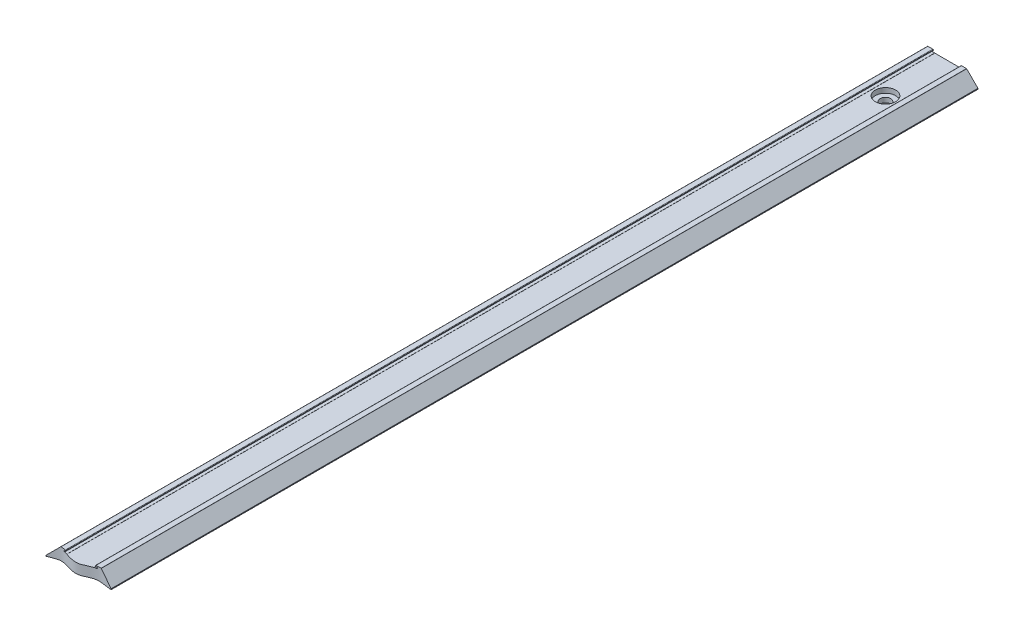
ISO-10303-21;
HEADER;
FILE_DESCRIPTION(('STEP AP214'),'2;1');
FILE_NAME('part.step','',(''),(''),'','','');
FILE_SCHEMA(('AUTOMOTIVE_DESIGN { 1 0 10303 214 1 1 1 1 }'));
ENDSEC;
DATA;
#1=APPLICATION_CONTEXT('core data for automotive mechanical design processes');
#2=APPLICATION_PROTOCOL_DEFINITION('international standard','automotive_design',2000,#1);
#3=PRODUCT_CONTEXT('',#1,'mechanical');
#4=PRODUCT('Part','Part','',(#3));
#5=PRODUCT_RELATED_PRODUCT_CATEGORY('part','',(#4));
#6=PRODUCT_DEFINITION_FORMATION('','',#4);
#7=PRODUCT_DEFINITION_CONTEXT('part definition',#1,'design');
#8=PRODUCT_DEFINITION('design','',#6,#7);
#9=PRODUCT_DEFINITION_SHAPE('','',#8);
#10=(LENGTH_UNIT() NAMED_UNIT(*) SI_UNIT(.MILLI.,.METRE.));
#11=(NAMED_UNIT(*) PLANE_ANGLE_UNIT() SI_UNIT($,.RADIAN.));
#12=(NAMED_UNIT(*) SI_UNIT($,.STERADIAN.) SOLID_ANGLE_UNIT());
#13=UNCERTAINTY_MEASURE_WITH_UNIT(LENGTH_MEASURE(1.E-05),#10,'distance_accuracy_value','');
#14=(GEOMETRIC_REPRESENTATION_CONTEXT(3) GLOBAL_UNCERTAINTY_ASSIGNED_CONTEXT((#13)) GLOBAL_UNIT_ASSIGNED_CONTEXT((#10,
#11,#12)) REPRESENTATION_CONTEXT('',''));
#15=CARTESIAN_POINT('',(0.,0.,0.));
#16=DIRECTION('',(0.,0.,1.));
#17=DIRECTION('',(1.,0.,0.));
#18=AXIS2_PLACEMENT_3D('',#15,#16,#17);
#19=CARTESIAN_POINT('',(3.,0.0499999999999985,300.));
#20=DIRECTION('',(-1.,0.,0.));
#21=DIRECTION('',(0.,-1.,0.));
#22=AXIS2_PLACEMENT_3D('',#19,#20,#21);
#23=PLANE('',#22);
#24=DIRECTION('',(0.,0.,-1.));
#25=VECTOR('',#24,1.);
#26=CARTESIAN_POINT('',(3.,0.0499999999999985,300.));
#27=LINE('',#26,#25);
#28=CARTESIAN_POINT('',(3.00000000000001,0.0499999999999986,281.162830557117));
#29=VERTEX_POINT('',#28);
#30=CARTESIAN_POINT('',(3.,0.0499999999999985,0.));
#31=VERTEX_POINT('',#30);
#32=EDGE_CURVE('E39',#29,#31,#27,.T.);
#33=ORIENTED_EDGE('',*,*,#32,.F.);
#34=DIRECTION('',(0.,1.,0.));
#35=VECTOR('',#34,1.);
#36=CARTESIAN_POINT('',(3.00000000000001,-1.,281.162830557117));
#37=LINE('',#36,#35);
#38=CARTESIAN_POINT('',(3.00000000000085,0.,281.162830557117));
#39=VERTEX_POINT('',#38);
#40=EDGE_CURVE('E586',#29,#39,#37,.F.);
#41=ORIENTED_EDGE('',*,*,#40,.T.);
#42=DIRECTION('',(0.,0.,-1.));
#43=VECTOR('',#42,1.);
#44=CARTESIAN_POINT('',(3.,0.,300.));
#45=LINE('',#44,#43);
#46=CARTESIAN_POINT('',(3.,0.,0.));
#47=VERTEX_POINT('',#46);
#48=EDGE_CURVE('E53',#39,#47,#45,.T.);
#49=ORIENTED_EDGE('',*,*,#48,.T.);
#50=DIRECTION('',(0.,1.,0.));
#51=VECTOR('',#50,1.);
#52=CARTESIAN_POINT('',(3.,0.0499999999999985,0.));
#53=LINE('',#52,#51);
#54=EDGE_CURVE('E326',#47,#31,#53,.T.);
#55=ORIENTED_EDGE('',*,*,#54,.T.);
#56=EDGE_LOOP('',(#33,#41,#49,#55));
#57=FACE_BOUND('',#56,.T.);
#58=ADVANCED_FACE('F31',(#57),#23,.F.);
#59=CARTESIAN_POINT('',(17.,0.0500000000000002,300.));
#60=DIRECTION('',(0.,1.,0.));
#61=DIRECTION('',(-1.,0.,0.));
#62=AXIS2_PLACEMENT_3D('',#59,#60,#61);
#63=PLANE('',#62);
#64=CARTESIAN_POINT('',(10.,0.0499999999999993,20.));
#65=DIRECTION('',(0.,1.,0.));
#66=DIRECTION('',(-1.,0.,0.));
#67=AXIS2_PLACEMENT_3D('',#64,#65,#66);
#68=CIRCLE('',#67,1.7);
#69=CARTESIAN_POINT('',(8.30000000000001,0.0499999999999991,20.));
#70=VERTEX_POINT('',#69);
#71=EDGE_CURVE('E34',#70,#70,#68,.T.);
#72=ORIENTED_EDGE('',*,*,#71,.T.);
#73=EDGE_LOOP('',(#72));
#74=FACE_BOUND('',#73,.T.);
#75=DIRECTION('',(0.,0.,-1.));
#76=VECTOR('',#75,1.);
#77=CARTESIAN_POINT('',(17.,0.0500000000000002,300.));
#78=LINE('',#77,#76);
#79=CARTESIAN_POINT('',(17.000000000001,0.0500000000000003,280.664933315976));
#80=VERTEX_POINT('',#79);
#81=CARTESIAN_POINT('',(17.,0.0500000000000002,0.));
#82=VERTEX_POINT('',#81);
#83=EDGE_CURVE('E305',#80,#82,#78,.T.);
#84=ORIENTED_EDGE('',*,*,#83,.F.);
#85=CARTESIAN_POINT('',(-9.98340160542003,0.0500000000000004,291.191806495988));
#86=CARTESIAN_POINT('',(-11.2860533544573,0.0500000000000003,301.346918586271));
#87=CARTESIAN_POINT('',(-3.63573120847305,0.0500000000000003,323.319147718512));
#88=CARTESIAN_POINT('',(38.2284837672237,0.0500000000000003,320.413119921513));
#89=CARTESIAN_POINT('',(37.5476223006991,0.0500000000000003,278.969296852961));
#90=CARTESIAN_POINT('',(21.0579265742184,0.0500000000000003,281.78406106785));
#91=CARTESIAN_POINT('',(14.6448500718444,0.0500000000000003,279.871369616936));
#92=CARTESIAN_POINT('',(9.56972510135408,0.0500000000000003,283.386292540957));
#93=CARTESIAN_POINT('',(4.01953894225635,0.0500000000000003,279.860043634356));
#94=CARTESIAN_POINT('',(-1.4318520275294,0.0500000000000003,283.305204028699));
#95=CARTESIAN_POINT('',(-8.40376374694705,0.0500000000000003,283.645966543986));
#96=CARTESIAN_POINT('',(-9.64573511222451,0.0500000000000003,288.559452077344));
#97=CARTESIAN_POINT('',(-9.98340160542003,0.0500000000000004,291.191806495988));
#98=B_SPLINE_CURVE_WITH_KNOTS('',3,(#85,#86,#87,#88,#89,#90,#91,#92,#93,#94,#95,#96,#97),
.UNSPECIFIED.,.T.,.F.,(4,1,1,1,1,1,1,1,1,1,4),(0.,0.205710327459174,0.442283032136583,
0.665986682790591,0.733790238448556,0.780289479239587,0.809524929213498,0.859884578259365,
0.900304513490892,0.94667685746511,1.),.UNSPECIFIED.);
#99=EDGE_CURVE('E321',#80,#29,#98,.T.);
#100=ORIENTED_EDGE('',*,*,#99,.T.);
#101=ORIENTED_EDGE('',*,*,#32,.T.);
#102=DIRECTION('',(1.,0.,0.));
#103=VECTOR('',#102,1.);
#104=CARTESIAN_POINT('',(17.,0.0500000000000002,0.));
#105=LINE('',#104,#103);
#106=EDGE_CURVE('E319',#31,#82,#105,.T.);
#107=ORIENTED_EDGE('',*,*,#106,.T.);
#108=EDGE_LOOP('',(#84,#100,#101,#107));
#109=FACE_BOUND('',#108,.T.);
#110=ADVANCED_FACE('F318',(#74,#109),#63,.F.);
#111=CARTESIAN_POINT('',(17.,0.,300.));
#112=DIRECTION('',(1.,0.,0.));
#113=DIRECTION('',(0.,0.,-1.));
#114=AXIS2_PLACEMENT_3D('',#111,#112,#113);
#115=PLANE('',#114);
#116=DIRECTION('',(0.,0.,-1.));
#117=VECTOR('',#116,1.);
#118=CARTESIAN_POINT('',(17.,0.,300.));
#119=LINE('',#118,#117);
#120=CARTESIAN_POINT('',(17.,0.,280.664933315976));
#121=VERTEX_POINT('',#120);
#122=CARTESIAN_POINT('',(17.,0.,0.));
#123=VERTEX_POINT('',#122);
#124=EDGE_CURVE('E303',#121,#123,#119,.T.);
#125=ORIENTED_EDGE('',*,*,#124,.F.);
#126=DIRECTION('',(0.,1.,0.));
#127=VECTOR('',#126,1.);
#128=CARTESIAN_POINT('',(17.,-1.,280.664933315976));
#129=LINE('',#128,#127);
#130=EDGE_CURVE('E1015',#121,#80,#129,.T.);
#131=ORIENTED_EDGE('',*,*,#130,.T.);
#132=ORIENTED_EDGE('',*,*,#83,.T.);
#133=DIRECTION('',(0.,-1.,0.));
#134=VECTOR('',#133,1.);
#135=CARTESIAN_POINT('',(17.,0.,0.));
#136=LINE('',#135,#134);
#137=EDGE_CURVE('E329',#82,#123,#136,.T.);
#138=ORIENTED_EDGE('',*,*,#137,.T.);
#139=EDGE_LOOP('',(#125,#131,#132,#138));
#140=FACE_BOUND('',#139,.T.);
#141=ADVANCED_FACE('F728',(#140),#115,.F.);
#142=CARTESIAN_POINT('',(19.9,0.,300.));
#143=DIRECTION('',(0.,1.,0.));
#144=DIRECTION('',(-1.,0.,0.));
#145=AXIS2_PLACEMENT_3D('',#142,#143,#144);
#146=PLANE('',#145);
#147=DIRECTION('',(0.,0.,-1.));
#148=VECTOR('',#147,1.);
#149=CARTESIAN_POINT('',(19.9,0.,300.));
#150=LINE('',#149,#148);
#151=CARTESIAN_POINT('',(19.8999999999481,0.,281.060646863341));
#152=VERTEX_POINT('',#151);
#153=CARTESIAN_POINT('',(19.9,0.,0.));
#154=VERTEX_POINT('',#153);
#155=EDGE_CURVE('E301',#152,#154,#150,.T.);
#156=ORIENTED_EDGE('',*,*,#155,.F.);
#157=CARTESIAN_POINT('',(-9.98340160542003,0.,291.191806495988));
#158=CARTESIAN_POINT('',(-11.2860533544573,0.,301.346918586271));
#159=CARTESIAN_POINT('',(-3.63573120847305,0.,323.319147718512));
#160=CARTESIAN_POINT('',(38.2284837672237,0.,320.413119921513));
#161=CARTESIAN_POINT('',(37.5476223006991,0.,278.969296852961));
#162=CARTESIAN_POINT('',(21.0579265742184,0.,281.78406106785));
#163=CARTESIAN_POINT('',(14.6448500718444,0.,279.871369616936));
#164=CARTESIAN_POINT('',(9.56972510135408,0.,283.386292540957));
#165=CARTESIAN_POINT('',(4.01953894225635,0.,279.860043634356));
#166=CARTESIAN_POINT('',(-1.4318520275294,0.,283.305204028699));
#167=CARTESIAN_POINT('',(-8.40376374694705,0.,283.645966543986));
#168=CARTESIAN_POINT('',(-9.64573511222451,0.,288.559452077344));
#169=CARTESIAN_POINT('',(-9.98340160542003,0.,291.191806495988));
#170=B_SPLINE_CURVE_WITH_KNOTS('',3,(#157,#158,#159,#160,#161,#162,#163,#164,#165,#166,#167,
#168,#169),.UNSPECIFIED.,.T.,.F.,(4,1,1,1,1,1,1,1,1,1,4),(0.,0.205710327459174,
0.442283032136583,0.665986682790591,0.733790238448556,0.780289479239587,0.809524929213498,
0.859884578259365,0.900304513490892,0.94667685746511,1.),.UNSPECIFIED.);
#171=EDGE_CURVE('E757',#152,#121,#170,.T.);
#172=ORIENTED_EDGE('',*,*,#171,.T.);
#173=ORIENTED_EDGE('',*,*,#124,.T.);
#174=DIRECTION('',(1.,0.,0.));
#175=VECTOR('',#174,1.);
#176=CARTESIAN_POINT('',(19.9,0.,0.));
#177=LINE('',#176,#175);
#178=EDGE_CURVE('E343',#123,#154,#177,.T.);
#179=ORIENTED_EDGE('',*,*,#178,.T.);
#180=EDGE_LOOP('',(#156,#172,#173,#179));
#181=FACE_BOUND('',#180,.T.);
#182=ADVANCED_FACE('F733',(#181),#146,.F.);
#183=CARTESIAN_POINT('',(19.9,0.1,300.));
#184=DIRECTION('',(0.,0.,-1.));
#185=DIRECTION('',(-1.,0.,0.));
#186=AXIS2_PLACEMENT_3D('',#183,#184,#185);
#187=CYLINDRICAL_SURFACE('',#186,0.0999999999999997);
#188=DIRECTION('',(0.,0.,-1.));
#189=VECTOR('',#188,1.);
#190=CARTESIAN_POINT('',(20.,0.1,300.));
#191=LINE('',#190,#189);
#192=CARTESIAN_POINT('',(20.,0.1,281.071699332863));
#193=VERTEX_POINT('',#192);
#194=CARTESIAN_POINT('',(20.,0.1,0.));
#195=VERTEX_POINT('',#194);
#196=EDGE_CURVE('E299',#193,#195,#191,.T.);
#197=ORIENTED_EDGE('',*,*,#196,.F.);
#198=CARTESIAN_POINT('',(20.,0.1,281.071699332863));
#199=CARTESIAN_POINT('',(19.9999998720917,0.0943923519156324,281.071699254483));
#200=CARTESIAN_POINT('',(19.9995270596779,0.0887948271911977,281.071648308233));
#201=CARTESIAN_POINT('',(19.9976572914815,0.0777637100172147,281.07144646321));
#202=CARTESIAN_POINT('',(19.99626120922,0.0723299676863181,281.071295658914));
#203=CARTESIAN_POINT('',(19.9907302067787,0.0565070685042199,281.07069725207));
#204=CARTESIAN_POINT('',(19.9852522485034,0.0465588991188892,281.070103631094));
#205=CARTESIAN_POINT('',(19.9713422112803,0.0290297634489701,281.068586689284));
#206=CARTESIAN_POINT('',(19.9629027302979,0.021454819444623,281.06766254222));
#207=CARTESIAN_POINT('',(19.9439566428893,0.00948582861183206,281.065571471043));
#208=CARTESIAN_POINT('',(19.9334388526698,0.00510962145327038,281.064403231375));
#209=CARTESIAN_POINT('',(19.9151335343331,0.000849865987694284,281.062354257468));
#210=CARTESIAN_POINT('',(19.9075618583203,-2.84163017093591E-05,281.061502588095));
#211=CARTESIAN_POINT('',(19.9000000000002,-1.27794910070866E-12,281.060646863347));
#212=B_SPLINE_CURVE_WITH_KNOTS('',3,(#198,#199,#200,#201,#202,#203,#204,#205,#206,#207,#208,
#209,#210,#211),.UNSPECIFIED.,.F.,.F.,(4,2,2,2,2,2,4),(0.,0.0167832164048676,0.0335505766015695,
0.0669787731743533,0.100491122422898,0.134188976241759,0.156998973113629),.UNSPECIFIED.);
#213=EDGE_CURVE('E749',#193,#152,#212,.T.);
#214=ORIENTED_EDGE('',*,*,#213,.T.);
#215=ORIENTED_EDGE('',*,*,#155,.T.);
#216=CARTESIAN_POINT('',(19.9,0.1,0.));
#217=DIRECTION('',(0.,0.,1.));
#218=DIRECTION('',(-1.,0.,0.));
#219=AXIS2_PLACEMENT_3D('',#216,#217,#218);
#220=CIRCLE('',#219,0.0999999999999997);
#221=EDGE_CURVE('E346',#154,#195,#220,.T.);
#222=ORIENTED_EDGE('',*,*,#221,.T.);
#223=EDGE_LOOP('',(#197,#214,#215,#222));
#224=FACE_BOUND('',#223,.T.);
#225=ADVANCED_FACE('F740',(#224),#187,.T.);
#226=CARTESIAN_POINT('',(20.,0.25857864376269,300.));
#227=DIRECTION('',(-1.,0.,0.));
#228=DIRECTION('',(0.,0.,1.));
#229=AXIS2_PLACEMENT_3D('',#226,#227,#228);
#230=PLANE('',#229);
#231=DIRECTION('',(0.,0.,-1.));
#232=VECTOR('',#231,1.);
#233=CARTESIAN_POINT('',(20.,0.25857864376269,300.));
#234=LINE('',#233,#232);
#235=CARTESIAN_POINT('',(20.,0.25857864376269,281.071699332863));
#236=VERTEX_POINT('',#235);
#237=CARTESIAN_POINT('',(20.,0.25857864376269,0.));
#238=VERTEX_POINT('',#237);
#239=EDGE_CURVE('E297',#236,#238,#234,.T.);
#240=ORIENTED_EDGE('',*,*,#239,.F.);
#241=DIRECTION('',(0.,1.,0.));
#242=VECTOR('',#241,1.);
#243=CARTESIAN_POINT('',(20.,-1.,281.071699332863));
#244=LINE('',#243,#242);
#245=EDGE_CURVE('E756',#236,#193,#244,.F.);
#246=ORIENTED_EDGE('',*,*,#245,.T.);
#247=ORIENTED_EDGE('',*,*,#196,.T.);
#248=DIRECTION('',(0.,1.,0.));
#249=VECTOR('',#248,1.);
#250=CARTESIAN_POINT('',(20.,0.25857864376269,0.));
#251=LINE('',#250,#249);
#252=EDGE_CURVE('E349',#195,#238,#251,.T.);
#253=ORIENTED_EDGE('',*,*,#252,.T.);
#254=EDGE_LOOP('',(#240,#246,#247,#253));
#255=FACE_BOUND('',#254,.T.);
#256=ADVANCED_FACE('F745',(#255),#230,.F.);
#257=CARTESIAN_POINT('',(19.9,0.258578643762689,300.));
#258=DIRECTION('',(0.,0.,-1.));
#259=DIRECTION('',(-1.,0.,0.));
#260=AXIS2_PLACEMENT_3D('',#257,#258,#259);
#261=CYLINDRICAL_SURFACE('',#260,0.0999999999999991);
#262=DIRECTION('',(0.,0.,-1.));
#263=VECTOR('',#262,1.);
#264=CARTESIAN_POINT('',(19.9707106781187,0.329289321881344,300.));
#265=LINE('',#264,#263);
#266=CARTESIAN_POINT('',(19.9707106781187,0.329289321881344,281.068516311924));
#267=VERTEX_POINT('',#266);
#268=CARTESIAN_POINT('',(19.9707106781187,0.329289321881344,0.));
#269=VERTEX_POINT('',#268);
#270=EDGE_CURVE('E290',#267,#269,#265,.T.);
#271=ORIENTED_EDGE('',*,*,#270,.F.);
#272=CARTESIAN_POINT('',(19.9707106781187,0.329289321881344,281.068516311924));
#273=CARTESIAN_POINT('',(19.9746716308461,0.325335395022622,281.068949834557));
#274=CARTESIAN_POINT('',(19.9782950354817,0.321040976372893,281.06934519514));
#275=CARTESIAN_POINT('',(19.9847818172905,0.311900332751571,281.07005148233));
#276=CARTESIAN_POINT('',(19.9876445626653,0.307053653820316,281.070362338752));
#277=CARTESIAN_POINT('',(19.9925202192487,0.296940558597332,281.070890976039));
#278=CARTESIAN_POINT('',(19.9945324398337,0.291673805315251,281.071108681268));
#279=CARTESIAN_POINT('',(19.9976412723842,0.28088442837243,281.071444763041));
#280=CARTESIAN_POINT('',(19.9987397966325,0.275362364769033,281.071563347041));
#281=CARTESIAN_POINT('',(19.9997902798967,0.266067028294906,281.071676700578));
#282=CARTESIAN_POINT('',(20.0000018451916,0.262321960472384,281.071699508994));
#283=CARTESIAN_POINT('',(20.,0.25857864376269,281.071699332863));
#284=B_SPLINE_CURVE_WITH_KNOTS('',3,(#272,#273,#274,#275,#276,#277,#278,#279,#280,#281,#282,
#283),.UNSPECIFIED.,.F.,.F.,(4,2,2,2,2,4),(0.,0.0168189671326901,0.0336518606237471,
0.0504983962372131,0.0673095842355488,0.0785382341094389),.UNSPECIFIED.);
#285=EDGE_CURVE('E763',#267,#236,#284,.T.);
#286=ORIENTED_EDGE('',*,*,#285,.T.);
#287=ORIENTED_EDGE('',*,*,#239,.T.);
#288=CARTESIAN_POINT('',(19.9,0.258578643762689,0.));
#289=DIRECTION('',(0.,0.,1.));
#290=DIRECTION('',(-1.,0.,0.));
#291=AXIS2_PLACEMENT_3D('',#288,#289,#290);
#292=CIRCLE('',#291,0.0999999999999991);
#293=EDGE_CURVE('E352',#238,#269,#292,.T.);
#294=ORIENTED_EDGE('',*,*,#293,.T.);
#295=EDGE_LOOP('',(#271,#286,#287,#294));
#296=FACE_BOUND('',#295,.T.);
#297=ADVANCED_FACE('F772',(#296),#261,.T.);
#298=CARTESIAN_POINT('',(16.3292893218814,3.97071067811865,300.));
#299=DIRECTION('',(-0.707106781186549,-0.707106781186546,0.));
#300=DIRECTION('',(0.707106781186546,-0.707106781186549,0.));
#301=AXIS2_PLACEMENT_3D('',#298,#299,#300);
#302=PLANE('',#301);
#303=DIRECTION('',(0.,0.,-1.));
#304=VECTOR('',#303,1.);
#305=CARTESIAN_POINT('',(16.3292893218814,3.97071067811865,300.));
#306=LINE('',#305,#304);
#307=CARTESIAN_POINT('',(16.3292893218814,3.97071067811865,280.608486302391));
#308=VERTEX_POINT('',#307);
#309=CARTESIAN_POINT('',(16.3292893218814,3.97071067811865,0.));
#310=VERTEX_POINT('',#309);
#311=EDGE_CURVE('E288',#308,#310,#306,.T.);
#312=ORIENTED_EDGE('',*,*,#311,.F.);
#313=CARTESIAN_POINT('',(16.3292893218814,3.97071067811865,280.608486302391));
#314=CARTESIAN_POINT('',(16.5323387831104,3.76766121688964,280.620277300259));
#315=CARTESIAN_POINT('',(16.7351624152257,3.5648375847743,280.637440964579));
#316=CARTESIAN_POINT('',(17.1403684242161,3.1596315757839,280.679319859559));
#317=CARTESIAN_POINT('',(17.3427509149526,2.95724908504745,280.704032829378));
#318=CARTESIAN_POINT('',(17.7472323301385,2.55276766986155,280.757830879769));
#319=CARTESIAN_POINT('',(17.9493312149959,2.35066878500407,280.786916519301));
#320=CARTESIAN_POINT('',(18.3533865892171,1.94661341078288,280.846561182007));
#321=CARTESIAN_POINT('',(18.555343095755,1.744656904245,280.877119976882));
#322=CARTESIAN_POINT('',(18.9593608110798,1.34063918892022,280.936968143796));
#323=CARTESIAN_POINT('',(19.1614220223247,1.13857797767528,280.966257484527));
#324=CARTESIAN_POINT('',(19.5658228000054,0.734177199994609,281.020953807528));
#325=CARTESIAN_POINT('',(19.7681623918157,0.531837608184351,281.046360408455));
#326=CARTESIAN_POINT('',(19.9707106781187,0.329289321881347,281.068516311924));
#327=B_SPLINE_CURVE_WITH_KNOTS('',3,(#313,#314,#315,#316,#317,#318,#319,#320,#321,#322,#323,
#324,#325,#326),.UNSPECIFIED.,.F.,.F.,(4,2,2,2,2,2,4),(0.,0.862003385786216,1.72374887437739,
2.58560461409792,3.44732721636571,4.30907105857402,5.17089948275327),.UNSPECIFIED.);
#328=EDGE_CURVE('E269',#308,#267,#327,.T.);
#329=ORIENTED_EDGE('',*,*,#328,.T.);
#330=ORIENTED_EDGE('',*,*,#270,.T.);
#331=DIRECTION('',(-0.707106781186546,0.707106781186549,0.));
#332=VECTOR('',#331,1.);
#333=CARTESIAN_POINT('',(16.3292893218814,3.97071067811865,0.));
#334=LINE('',#333,#332);
#335=EDGE_CURVE('E355',#269,#310,#334,.T.);
#336=ORIENTED_EDGE('',*,*,#335,.T.);
#337=EDGE_LOOP('',(#312,#329,#330,#336));
#338=FACE_BOUND('',#337,.T.);
#339=ADVANCED_FACE('F775',(#338),#302,.F.);
#340=CARTESIAN_POINT('',(16.2585786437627,3.9,300.));
#341=DIRECTION('',(0.,0.,-1.));
#342=DIRECTION('',(-1.,0.,0.));
#343=AXIS2_PLACEMENT_3D('',#340,#341,#342);
#344=CYLINDRICAL_SURFACE('',#343,0.100000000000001);
#345=DIRECTION('',(0.,0.,-1.));
#346=VECTOR('',#345,1.);
#347=CARTESIAN_POINT('',(16.2585786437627,4.,300.));
#348=LINE('',#347,#346);
#349=CARTESIAN_POINT('',(16.2585786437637,4.,280.604619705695));
#350=VERTEX_POINT('',#349);
#351=CARTESIAN_POINT('',(16.2585786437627,4.,0.));
#352=VERTEX_POINT('',#351);
#353=EDGE_CURVE('E279',#350,#352,#348,.T.);
#354=ORIENTED_EDGE('',*,*,#353,.F.);
#355=CARTESIAN_POINT('',(16.2585786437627,4.,280.604619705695));
#356=CARTESIAN_POINT('',(16.2642071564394,4.0000048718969,280.60490926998));
#357=CARTESIAN_POINT('',(16.2698340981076,3.99952514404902,280.605203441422));
#358=CARTESIAN_POINT('',(16.2809329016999,3.99763059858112,280.605791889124));
#359=CARTESIAN_POINT('',(16.2864046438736,3.99621507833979,280.606086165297));
#360=CARTESIAN_POINT('',(16.2970357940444,3.9924818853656,280.606665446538));
#361=CARTESIAN_POINT('',(16.3021949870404,3.9901635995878,280.606950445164));
#362=CARTESIAN_POINT('',(16.312040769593,3.9846956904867,280.607500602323));
#363=CARTESIAN_POINT('',(16.3167283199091,3.98154780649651,280.607765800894));
#364=CARTESIAN_POINT('',(16.3239740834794,3.9757427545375,280.608179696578));
#365=CARTESIAN_POINT('',(16.3267041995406,3.9732981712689,280.608336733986));
#366=CARTESIAN_POINT('',(16.3292893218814,3.97071067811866,280.608486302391));
#367=B_SPLINE_CURVE_WITH_KNOTS('',3,(#355,#356,#357,#358,#359,#360,#361,#362,#363,#364,#365,
#366),.UNSPECIFIED.,.F.,.F.,(4,2,2,2,2,4),(0.,0.016885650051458,0.0337839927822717,
0.0506938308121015,0.0675684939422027,0.0785496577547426),.UNSPECIFIED.);
#368=EDGE_CURVE('E263',#350,#308,#367,.T.);
#369=ORIENTED_EDGE('',*,*,#368,.T.);
#370=ORIENTED_EDGE('',*,*,#311,.T.);
#371=CARTESIAN_POINT('',(16.2585786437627,3.9,0.));
#372=DIRECTION('',(0.,0.,1.));
#373=DIRECTION('',(1.,0.,0.));
#374=AXIS2_PLACEMENT_3D('',#371,#372,#373);
#375=CIRCLE('',#374,0.100000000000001);
#376=EDGE_CURVE('E286',#310,#352,#375,.T.);
#377=ORIENTED_EDGE('',*,*,#376,.T.);
#378=EDGE_LOOP('',(#354,#369,#370,#377));
#379=FACE_BOUND('',#378,.T.);
#380=ADVANCED_FACE('F284',(#379),#344,.T.);
#381=CARTESIAN_POINT('',(14.65,4.,300.));
#382=DIRECTION('',(0.,-1.,0.));
#383=DIRECTION('',(1.,0.,0.));
#384=AXIS2_PLACEMENT_3D('',#381,#382,#383);
#385=PLANE('',#384);
#386=DIRECTION('',(0.,0.,-1.));
#387=VECTOR('',#386,1.);
#388=CARTESIAN_POINT('',(14.65,4.,300.));
#389=LINE('',#388,#387);
#390=CARTESIAN_POINT('',(14.6499999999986,4.,280.674214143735));
#391=VERTEX_POINT('',#390);
#392=CARTESIAN_POINT('',(14.65,4.,0.));
#393=VERTEX_POINT('',#392);
#394=EDGE_CURVE('E281',#391,#393,#389,.T.);
#395=ORIENTED_EDGE('',*,*,#394,.F.);
#396=CARTESIAN_POINT('',(-9.98340160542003,4.,291.191806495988));
#397=CARTESIAN_POINT('',(-11.2860533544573,4.,301.346918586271));
#398=CARTESIAN_POINT('',(-3.63573120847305,4.,323.319147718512));
#399=CARTESIAN_POINT('',(38.2284837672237,4.,320.413119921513));
#400=CARTESIAN_POINT('',(37.5476223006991,4.,278.969296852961));
#401=CARTESIAN_POINT('',(21.0579265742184,4.,281.78406106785));
#402=CARTESIAN_POINT('',(14.6448500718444,4.,279.871369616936));
#403=CARTESIAN_POINT('',(9.56972510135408,4.,283.386292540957));
#404=CARTESIAN_POINT('',(4.01953894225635,4.,279.860043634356));
#405=CARTESIAN_POINT('',(-1.4318520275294,4.,283.305204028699));
#406=CARTESIAN_POINT('',(-8.40376374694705,4.,283.645966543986));
#407=CARTESIAN_POINT('',(-9.64573511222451,4.,288.559452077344));
#408=CARTESIAN_POINT('',(-9.98340160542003,4.,291.191806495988));
#409=B_SPLINE_CURVE_WITH_KNOTS('',3,(#396,#397,#398,#399,#400,#401,#402,#403,#404,#405,#406,
#407,#408),.UNSPECIFIED.,.T.,.F.,(4,1,1,1,1,1,1,1,1,1,4),(0.,0.205710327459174,
0.442283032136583,0.665986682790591,0.733790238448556,0.780289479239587,0.809524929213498,
0.859884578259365,0.900304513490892,0.94667685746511,1.),.UNSPECIFIED.);
#410=EDGE_CURVE('E266',#350,#391,#409,.T.);
#411=ORIENTED_EDGE('',*,*,#410,.F.);
#412=ORIENTED_EDGE('',*,*,#353,.T.);
#413=DIRECTION('',(-1.,0.,0.));
#414=VECTOR('',#413,1.);
#415=CARTESIAN_POINT('',(14.65,4.,0.));
#416=LINE('',#415,#414);
#417=EDGE_CURVE('E359',#352,#393,#416,.T.);
#418=ORIENTED_EDGE('',*,*,#417,.T.);
#419=EDGE_LOOP('',(#395,#411,#412,#418));
#420=FACE_BOUND('',#419,.T.);
#421=ADVANCED_FACE('F277',(#420),#385,.F.);
#422=CARTESIAN_POINT('',(14.65,3.85,300.));
#423=DIRECTION('',(0.,0.,-1.));
#424=DIRECTION('',(-1.,0.,0.));
#425=AXIS2_PLACEMENT_3D('',#422,#423,#424);
#426=CYLINDRICAL_SURFACE('',#425,0.150000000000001);
#427=DIRECTION('',(0.,0.,-1.));
#428=VECTOR('',#427,1.);
#429=CARTESIAN_POINT('',(14.5,3.85,300.));
#430=LINE('',#429,#428);
#431=CARTESIAN_POINT('',(14.4999999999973,3.85,280.700199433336));
#432=VERTEX_POINT('',#431);
#433=CARTESIAN_POINT('',(14.5,3.85,0.));
#434=VERTEX_POINT('',#433);
#435=EDGE_CURVE('E292',#432,#434,#430,.T.);
#436=ORIENTED_EDGE('',*,*,#435,.F.);
#437=CARTESIAN_POINT('',(14.5,3.85,280.700199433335));
#438=CARTESIAN_POINT('',(14.4999929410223,3.85833982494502,280.700201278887));
#439=CARTESIAN_POINT('',(14.5006952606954,3.86667599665,280.700069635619));
#440=CARTESIAN_POINT('',(14.5034629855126,3.88310008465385,280.699553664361));
#441=CARTESIAN_POINT('',(14.5055266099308,3.89118831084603,280.69916966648));
#442=CARTESIAN_POINT('',(14.5109623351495,3.90690084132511,280.698163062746));
#443=CARTESIAN_POINT('',(14.5143348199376,3.91452500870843,280.697540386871));
#444=CARTESIAN_POINT('',(14.5222750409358,3.92909126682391,280.696084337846));
#445=CARTESIAN_POINT('',(14.5268427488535,3.93603337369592,280.695250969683));
#446=CARTESIAN_POINT('',(14.5422334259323,3.95564996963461,280.692466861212));
#447=CARTESIAN_POINT('',(14.5547166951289,3.96703811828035,280.690237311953));
#448=CARTESIAN_POINT('',(14.5828942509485,3.98521147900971,280.68532667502));
#449=CARTESIAN_POINT('',(14.5986356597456,3.99192199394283,280.682639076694));
#450=CARTESIAN_POINT('',(14.6206991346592,3.99723085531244,280.678973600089));
#451=CARTESIAN_POINT('',(14.6265124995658,3.99826797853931,280.678016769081));
#452=CARTESIAN_POINT('',(14.6382137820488,3.99965108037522,280.676108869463));
#453=CARTESIAN_POINT('',(14.6441015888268,3.99999798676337,280.675157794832));
#454=CARTESIAN_POINT('',(14.6499999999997,4.00000000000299,280.674214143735));
#455=B_SPLINE_CURVE_WITH_KNOTS('',3,(#437,#438,#439,#440,#441,#442,#443,#444,#445,#446,#447,
#448,#449,#450,#451,#452,#453,#454),.UNSPECIFIED.,.F.,.F.,(4,2,2,2,2,2,2,2,4),(0.,
0.0249831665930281,0.04993371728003,0.0748915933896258,0.0998488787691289,0.14999616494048,
0.200926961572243,0.218842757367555,0.236734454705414),.UNSPECIFIED.);
#456=EDGE_CURVE('E331',#432,#391,#455,.T.);
#457=ORIENTED_EDGE('',*,*,#456,.T.);
#458=ORIENTED_EDGE('',*,*,#394,.T.);
#459=CARTESIAN_POINT('',(14.65,3.85,0.));
#460=DIRECTION('',(0.,0.,1.));
#461=DIRECTION('',(1.,0.,0.));
#462=AXIS2_PLACEMENT_3D('',#459,#460,#461);
#463=CIRCLE('',#462,0.150000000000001);
#464=EDGE_CURVE('E361',#393,#434,#463,.T.);
#465=ORIENTED_EDGE('',*,*,#464,.T.);
#466=EDGE_LOOP('',(#436,#457,#458,#465));
#467=FACE_BOUND('',#466,.T.);
#468=ADVANCED_FACE('F495',(#467),#426,.T.);
#469=CARTESIAN_POINT('',(14.5,3.75,300.));
#470=DIRECTION('',(1.,0.,0.));
#471=DIRECTION('',(0.,0.,-1.));
#472=AXIS2_PLACEMENT_3D('',#469,#470,#471);
#473=PLANE('',#472);
#474=DIRECTION('',(0.,0.,-1.));
#475=VECTOR('',#474,1.);
#476=CARTESIAN_POINT('',(14.5,3.75,300.));
#477=LINE('',#476,#475);
#478=CARTESIAN_POINT('',(14.5,3.75,280.700199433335));
#479=VERTEX_POINT('',#478);
#480=CARTESIAN_POINT('',(14.5,3.75,0.));
#481=VERTEX_POINT('',#480);
#482=EDGE_CURVE('E485',#479,#481,#477,.T.);
#483=ORIENTED_EDGE('',*,*,#482,.F.);
#484=DIRECTION('',(0.,1.,0.));
#485=VECTOR('',#484,1.);
#486=CARTESIAN_POINT('',(14.4999999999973,-1.,280.700199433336));
#487=LINE('',#486,#485);
#488=EDGE_CURVE('E333',#479,#432,#487,.T.);
#489=ORIENTED_EDGE('',*,*,#488,.T.);
#490=ORIENTED_EDGE('',*,*,#435,.T.);
#491=DIRECTION('',(0.,-1.,0.));
#492=VECTOR('',#491,1.);
#493=CARTESIAN_POINT('',(14.5,3.75,0.));
#494=LINE('',#493,#492);
#495=EDGE_CURVE('E364',#434,#481,#494,.T.);
#496=ORIENTED_EDGE('',*,*,#495,.T.);
#497=EDGE_LOOP('',(#483,#489,#490,#496));
#498=FACE_BOUND('',#497,.T.);
#499=ADVANCED_FACE('F490',(#498),#473,.F.);
#500=CARTESIAN_POINT('',(14.65,3.75,300.));
#501=DIRECTION('',(0.,0.,-1.));
#502=DIRECTION('',(-1.,0.,0.));
#503=AXIS2_PLACEMENT_3D('',#500,#501,#502);
#504=CYLINDRICAL_SURFACE('',#503,0.15);
#505=DIRECTION('',(0.,0.,-1.));
#506=VECTOR('',#505,1.);
#507=CARTESIAN_POINT('',(14.65,3.6,300.));
#508=LINE('',#507,#506);
#509=CARTESIAN_POINT('',(14.6499999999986,3.6,280.674214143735));
#510=VERTEX_POINT('',#509);
#511=CARTESIAN_POINT('',(14.65,3.6,0.));
#512=VERTEX_POINT('',#511);
#513=EDGE_CURVE('E483',#510,#512,#508,.T.);
#514=ORIENTED_EDGE('',*,*,#513,.F.);
#515=CARTESIAN_POINT('',(14.65,3.6,280.674214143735));
#516=CARTESIAN_POINT('',(14.6414525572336,3.59999982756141,280.675581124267));
#517=CARTESIAN_POINT('',(14.6329235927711,3.60073191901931,280.67696519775));
#518=CARTESIAN_POINT('',(14.6161161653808,3.6036280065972,280.679729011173));
#519=CARTESIAN_POINT('',(14.607837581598,3.60579129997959,280.681108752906));
#520=CARTESIAN_POINT('',(14.5837360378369,3.61436194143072,280.685177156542));
#521=CARTESIAN_POINT('',(14.5685901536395,3.6228504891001,280.687804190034));
#522=CARTESIAN_POINT('',(14.5420515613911,3.64446206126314,280.692492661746));
#523=CARTESIAN_POINT('',(14.5306432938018,3.65756538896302,280.694556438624));
#524=CARTESIAN_POINT('',(14.517370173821,3.67941595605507,280.696982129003));
#525=CARTESIAN_POINT('',(14.5135948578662,3.68702328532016,280.697677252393));
#526=CARTESIAN_POINT('',(14.5073765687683,3.70278117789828,280.698826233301));
#527=CARTESIAN_POINT('',(14.5049324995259,3.71093128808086,280.699280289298));
#528=CARTESIAN_POINT('',(14.501068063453,3.72933470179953,280.699999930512));
#529=CARTESIAN_POINT('',(14.4999832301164,3.73966178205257,280.700203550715));
#530=CARTESIAN_POINT('',(14.4999999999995,3.74999999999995,280.700199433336));
#531=B_SPLINE_CURVE_WITH_KNOTS('',3,(#515,#516,#517,#518,#519,#520,#521,#522,#523,#524,#525,
#526,#527,#528,#529,#530),.UNSPECIFIED.,.F.,.F.,(4,2,2,2,2,2,2,4),(0.,0.0259071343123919,
0.0518015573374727,0.103425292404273,0.154831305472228,0.180288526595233,0.205724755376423,
0.236659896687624),.UNSPECIFIED.);
#532=EDGE_CURVE('E502',#510,#479,#531,.T.);
#533=ORIENTED_EDGE('',*,*,#532,.T.);
#534=ORIENTED_EDGE('',*,*,#482,.T.);
#535=CARTESIAN_POINT('',(14.65,3.75,0.));
#536=DIRECTION('',(0.,0.,1.));
#537=DIRECTION('',(1.,0.,0.));
#538=AXIS2_PLACEMENT_3D('',#535,#536,#537);
#539=CIRCLE('',#538,0.15);
#540=EDGE_CURVE('E367',#481,#512,#539,.T.);
#541=ORIENTED_EDGE('',*,*,#540,.T.);
#542=EDGE_LOOP('',(#514,#533,#534,#541));
#543=FACE_BOUND('',#542,.T.);
#544=ADVANCED_FACE('F500',(#543),#504,.T.);
#545=CARTESIAN_POINT('',(14.975,3.6,300.));
#546=DIRECTION('',(0.,1.,0.));
#547=DIRECTION('',(0.,0.,1.));
#548=AXIS2_PLACEMENT_3D('',#545,#546,#547);
#549=PLANE('',#548);
#550=DIRECTION('',(0.,0.,-1.));
#551=VECTOR('',#550,1.);
#552=CARTESIAN_POINT('',(14.975,3.6,300.));
#553=LINE('',#552,#551);
#554=CARTESIAN_POINT('',(14.975,3.6,280.631082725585));
#555=VERTEX_POINT('',#554);
#556=CARTESIAN_POINT('',(14.975,3.6,0.));
#557=VERTEX_POINT('',#556);
#558=EDGE_CURVE('E481',#555,#557,#553,.T.);
#559=ORIENTED_EDGE('',*,*,#558,.F.);
#560=CARTESIAN_POINT('',(-9.98340160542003,3.6,291.191806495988));
#561=CARTESIAN_POINT('',(-11.2860533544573,3.6,301.346918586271));
#562=CARTESIAN_POINT('',(-3.63573120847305,3.6,323.319147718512));
#563=CARTESIAN_POINT('',(38.2284837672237,3.6,320.413119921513));
#564=CARTESIAN_POINT('',(37.5476223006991,3.6,278.969296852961));
#565=CARTESIAN_POINT('',(21.0579265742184,3.6,281.78406106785));
#566=CARTESIAN_POINT('',(14.6448500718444,3.6,279.871369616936));
#567=CARTESIAN_POINT('',(9.56972510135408,3.6,283.386292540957));
#568=CARTESIAN_POINT('',(4.01953894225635,3.6,279.860043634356));
#569=CARTESIAN_POINT('',(-1.4318520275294,3.6,283.305204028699));
#570=CARTESIAN_POINT('',(-8.40376374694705,3.6,283.645966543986));
#571=CARTESIAN_POINT('',(-9.64573511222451,3.6,288.559452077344));
#572=CARTESIAN_POINT('',(-9.98340160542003,3.6,291.191806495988));
#573=B_SPLINE_CURVE_WITH_KNOTS('',3,(#560,#561,#562,#563,#564,#565,#566,#567,#568,#569,#570,
#571,#572),.UNSPECIFIED.,.T.,.F.,(4,1,1,1,1,1,1,1,1,1,4),(0.,0.205710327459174,
0.442283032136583,0.665986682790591,0.733790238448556,0.780289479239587,0.809524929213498,
0.859884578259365,0.900304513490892,0.94667685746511,1.),.UNSPECIFIED.);
#574=EDGE_CURVE('E504',#555,#510,#573,.T.);
#575=ORIENTED_EDGE('',*,*,#574,.T.);
#576=ORIENTED_EDGE('',*,*,#513,.T.);
#577=DIRECTION('',(1.,0.,0.));
#578=VECTOR('',#577,1.);
#579=CARTESIAN_POINT('',(14.975,3.6,0.));
#580=LINE('',#579,#578);
#581=EDGE_CURVE('E370',#512,#557,#580,.T.);
#582=ORIENTED_EDGE('',*,*,#581,.T.);
#583=EDGE_LOOP('',(#559,#575,#576,#582));
#584=FACE_BOUND('',#583,.T.);
#585=ADVANCED_FACE('F716',(#584),#549,.F.);
#586=CARTESIAN_POINT('',(14.975,3.45,300.));
#587=DIRECTION('',(0.,0.,-1.));
#588=DIRECTION('',(-1.,0.,0.));
#589=AXIS2_PLACEMENT_3D('',#586,#587,#588);
#590=CYLINDRICAL_SURFACE('',#589,0.15);
#591=DIRECTION('',(0.,0.,-1.));
#592=VECTOR('',#591,1.);
#593=CARTESIAN_POINT('',(15.125,3.45,300.));
#594=LINE('',#593,#592);
#595=CARTESIAN_POINT('',(15.125,3.45,280.616844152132));
#596=VERTEX_POINT('',#595);
#597=CARTESIAN_POINT('',(15.125,3.45,0.));
#598=VERTEX_POINT('',#597);
#599=EDGE_CURVE('E479',#596,#598,#594,.T.);
#600=ORIENTED_EDGE('',*,*,#599,.F.);
#601=CARTESIAN_POINT('',(15.125,3.45,280.616844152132));
#602=CARTESIAN_POINT('',(15.1250066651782,3.4584161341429,280.616844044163));
#603=CARTESIAN_POINT('',(15.1242918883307,3.46682941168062,280.616903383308));
#604=CARTESIAN_POINT('',(15.1214714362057,3.48341058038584,280.617139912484));
#605=CARTESIAN_POINT('',(15.1193669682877,3.49157867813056,280.617317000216));
#606=CARTESIAN_POINT('',(15.1138176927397,3.50744883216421,280.617788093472));
#607=CARTESIAN_POINT('',(15.1103722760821,3.51515067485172,280.618082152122));
#608=CARTESIAN_POINT('',(15.1022527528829,3.52985999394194,280.618783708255));
#609=CARTESIAN_POINT('',(15.0975788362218,3.53686757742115,280.619191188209));
#610=CARTESIAN_POINT('',(15.0818859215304,3.5565599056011,280.620579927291));
#611=CARTESIAN_POINT('',(15.0691827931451,3.56795034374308,280.621728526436));
#612=CARTESIAN_POINT('',(15.0406926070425,3.5858997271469,280.624410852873));
#613=CARTESIAN_POINT('',(15.0248952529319,3.5924421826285,280.625945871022));
#614=CARTESIAN_POINT('',(15.0030464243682,3.59746509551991,280.628156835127));
#615=CARTESIAN_POINT('',(14.9974754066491,3.59841490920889,280.628727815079));
#616=CARTESIAN_POINT('',(14.9862721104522,3.59968089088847,280.629890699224));
#617=CARTESIAN_POINT('',(14.9806399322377,3.59999797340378,280.630482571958));
#618=CARTESIAN_POINT('',(14.9750000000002,3.60000000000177,280.631082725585));
#619=B_SPLINE_CURVE_WITH_KNOTS('',3,(#601,#602,#603,#604,#605,#606,#607,#608,#609,#610,#611,
#612,#613,#614,#615,#616,#617,#618),.UNSPECIFIED.,.F.,.F.,(4,2,2,2,2,2,2,2,4),(0.,
0.0252134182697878,0.0504049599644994,0.0756079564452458,0.100807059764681,0.151095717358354,
0.201554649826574,0.218568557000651,0.235557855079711),.UNSPECIFIED.);
#620=EDGE_CURVE('E506',#596,#555,#619,.T.);
#621=ORIENTED_EDGE('',*,*,#620,.T.);
#622=ORIENTED_EDGE('',*,*,#558,.T.);
#623=CARTESIAN_POINT('',(14.975,3.45,0.));
#624=DIRECTION('',(0.,0.,-1.));
#625=DIRECTION('',(-1.,0.,0.));
#626=AXIS2_PLACEMENT_3D('',#623,#624,#625);
#627=CIRCLE('',#626,0.15);
#628=EDGE_CURVE('E373',#557,#598,#627,.T.);
#629=ORIENTED_EDGE('',*,*,#628,.T.);
#630=EDGE_LOOP('',(#600,#621,#622,#629));
#631=FACE_BOUND('',#630,.T.);
#632=ADVANCED_FACE('F713',(#631),#590,.F.);
#633=CARTESIAN_POINT('',(15.125,3.4,300.));
#634=DIRECTION('',(1.,0.,0.));
#635=DIRECTION('',(0.,0.,-1.));
#636=AXIS2_PLACEMENT_3D('',#633,#634,#635);
#637=PLANE('',#636);
#638=DIRECTION('',(0.,0.,-1.));
#639=VECTOR('',#638,1.);
#640=CARTESIAN_POINT('',(15.125,3.4,300.));
#641=LINE('',#640,#639);
#642=CARTESIAN_POINT('',(15.125,3.4,280.616844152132));
#643=VERTEX_POINT('',#642);
#644=CARTESIAN_POINT('',(15.125,3.4,0.));
#645=VERTEX_POINT('',#644);
#646=EDGE_CURVE('E477',#643,#645,#641,.T.);
#647=ORIENTED_EDGE('',*,*,#646,.F.);
#648=DIRECTION('',(0.,1.,0.));
#649=VECTOR('',#648,1.);
#650=CARTESIAN_POINT('',(15.125,-1.,280.616844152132));
#651=LINE('',#650,#649);
#652=EDGE_CURVE('E703',#643,#596,#651,.T.);
#653=ORIENTED_EDGE('',*,*,#652,.T.);
#654=ORIENTED_EDGE('',*,*,#599,.T.);
#655=DIRECTION('',(0.,-1.,0.));
#656=VECTOR('',#655,1.);
#657=CARTESIAN_POINT('',(15.125,3.4,0.));
#658=LINE('',#657,#656);
#659=EDGE_CURVE('E376',#598,#645,#658,.T.);
#660=ORIENTED_EDGE('',*,*,#659,.T.);
#661=EDGE_LOOP('',(#647,#653,#654,#660));
#662=FACE_BOUND('',#661,.T.);
#663=ADVANCED_FACE('F692',(#662),#637,.F.);
#664=CARTESIAN_POINT('',(14.975,3.4,300.));
#665=DIRECTION('',(0.,0.,-1.));
#666=DIRECTION('',(-1.,0.,0.));
#667=AXIS2_PLACEMENT_3D('',#664,#665,#666);
#668=CYLINDRICAL_SURFACE('',#667,0.15);
#669=DIRECTION('',(0.,0.,-1.));
#670=VECTOR('',#669,1.);
#671=CARTESIAN_POINT('',(14.975,3.25,300.));
#672=LINE('',#671,#670);
#673=CARTESIAN_POINT('',(14.9750000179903,3.25,280.631082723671));
#674=VERTEX_POINT('',#673);
#675=CARTESIAN_POINT('',(14.975,3.25,0.));
#676=VERTEX_POINT('',#675);
#677=EDGE_CURVE('E475',#674,#676,#672,.T.);
#678=ORIENTED_EDGE('',*,*,#677,.F.);
#679=CARTESIAN_POINT('',(14.975,3.25,280.631082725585));
#680=CARTESIAN_POINT('',(14.9834592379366,3.2499935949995,280.630181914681));
#681=CARTESIAN_POINT('',(14.9919180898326,3.25071545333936,280.629299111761));
#682=CARTESIAN_POINT('',(15.0085956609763,3.25356785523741,280.627590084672));
#683=CARTESIAN_POINT('',(15.016814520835,3.25569755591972,280.626763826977));
#684=CARTESIAN_POINT('',(15.0327880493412,3.26131953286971,280.625186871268));
#685=CARTESIAN_POINT('',(15.0405424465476,3.26481259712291,280.624436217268));
#686=CARTESIAN_POINT('',(15.0553504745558,3.2730514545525,280.623026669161));
#687=CARTESIAN_POINT('',(15.0624042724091,3.27779694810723,280.622367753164));
#688=CARTESIAN_POINT('',(15.0821598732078,3.29370129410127,280.620550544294));
#689=CARTESIAN_POINT('',(15.0935678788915,3.30656836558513,280.619540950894));
#690=CARTESIAN_POINT('',(15.1113830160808,3.33531758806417,280.617990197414));
#691=CARTESIAN_POINT('',(15.117811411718,3.35118655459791,280.617447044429));
#692=CARTESIAN_POINT('',(15.1238295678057,3.3782674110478,280.616942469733));
#693=CARTESIAN_POINT('',(15.1250349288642,3.38913839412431,280.616843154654));
#694=CARTESIAN_POINT('',(15.1250000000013,3.39999999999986,280.616844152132));
#695=B_SPLINE_CURVE_WITH_KNOTS('',3,(#679,#680,#681,#682,#683,#684,#685,#686,#687,#688,#689,
#690,#691,#692,#693,#694),.UNSPECIFIED.,.F.,.F.,(4,2,2,2,2,2,2,4),(0.,0.025486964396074,
0.0509586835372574,0.0764451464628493,0.101925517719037,0.152545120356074,0.202947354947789,
0.235500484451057),.UNSPECIFIED.);
#696=EDGE_CURVE('E696',#674,#643,#695,.T.);
#697=ORIENTED_EDGE('',*,*,#696,.T.);
#698=ORIENTED_EDGE('',*,*,#646,.T.);
#699=CARTESIAN_POINT('',(14.975,3.4,0.));
#700=DIRECTION('',(0.,0.,-1.));
#701=DIRECTION('',(-1.,0.,0.));
#702=AXIS2_PLACEMENT_3D('',#699,#700,#701);
#703=CIRCLE('',#702,0.15);
#704=EDGE_CURVE('E379',#645,#676,#703,.T.);
#705=ORIENTED_EDGE('',*,*,#704,.T.);
#706=EDGE_LOOP('',(#678,#697,#698,#705));
#707=FACE_BOUND('',#706,.T.);
#708=ADVANCED_FACE('F687',(#707),#668,.F.);
#709=CARTESIAN_POINT('',(14.,3.25,300.));
#710=DIRECTION('',(0.,-1.,0.));
#711=DIRECTION('',(0.,0.,-1.));
#712=AXIS2_PLACEMENT_3D('',#709,#710,#711);
#713=PLANE('',#712);
#714=DIRECTION('',(0.,0.,-1.));
#715=VECTOR('',#714,1.);
#716=CARTESIAN_POINT('',(14.,3.25,300.));
#717=LINE('',#716,#715);
#718=CARTESIAN_POINT('',(14.,3.25,280.81757783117));
#719=VERTEX_POINT('',#718);
#720=CARTESIAN_POINT('',(14.,3.25,0.));
#721=VERTEX_POINT('',#720);
#722=EDGE_CURVE('E473',#719,#721,#717,.T.);
#723=ORIENTED_EDGE('',*,*,#722,.F.);
#724=CARTESIAN_POINT('',(-9.98340160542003,3.25,291.191806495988));
#725=CARTESIAN_POINT('',(-11.2860533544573,3.25,301.346918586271));
#726=CARTESIAN_POINT('',(-3.63573120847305,3.25,323.319147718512));
#727=CARTESIAN_POINT('',(38.2284837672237,3.25,320.413119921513));
#728=CARTESIAN_POINT('',(37.5476223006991,3.25,278.969296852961));
#729=CARTESIAN_POINT('',(21.0579265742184,3.25,281.78406106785));
#730=CARTESIAN_POINT('',(14.6448500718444,3.25,279.871369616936));
#731=CARTESIAN_POINT('',(9.56972510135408,3.25,283.386292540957));
#732=CARTESIAN_POINT('',(4.01953894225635,3.25,279.860043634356));
#733=CARTESIAN_POINT('',(-1.4318520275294,3.25,283.305204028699));
#734=CARTESIAN_POINT('',(-8.40376374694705,3.25,283.645966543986));
#735=CARTESIAN_POINT('',(-9.64573511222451,3.25,288.559452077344));
#736=CARTESIAN_POINT('',(-9.98340160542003,3.25,291.191806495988));
#737=B_SPLINE_CURVE_WITH_KNOTS('',3,(#724,#725,#726,#727,#728,#729,#730,#731,#732,#733,#734,
#735,#736),.UNSPECIFIED.,.T.,.F.,(4,1,1,1,1,1,1,1,1,1,4),(0.,0.205710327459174,
0.442283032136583,0.665986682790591,0.733790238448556,0.780289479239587,0.809524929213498,
0.859884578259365,0.900304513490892,0.94667685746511,1.),.UNSPECIFIED.);
#738=EDGE_CURVE('E704',#719,#674,#737,.F.);
#739=ORIENTED_EDGE('',*,*,#738,.T.);
#740=ORIENTED_EDGE('',*,*,#677,.T.);
#741=DIRECTION('',(-1.,0.,0.));
#742=VECTOR('',#741,1.);
#743=CARTESIAN_POINT('',(14.,3.25,0.));
#744=LINE('',#743,#742);
#745=EDGE_CURVE('E382',#676,#721,#744,.T.);
#746=ORIENTED_EDGE('',*,*,#745,.T.);
#747=EDGE_LOOP('',(#723,#739,#740,#746));
#748=FACE_BOUND('',#747,.T.);
#749=ADVANCED_FACE('F683',(#748),#713,.F.);
#750=CARTESIAN_POINT('',(14.,3.25,300.));
#751=DIRECTION('',(1.,0.,0.));
#752=DIRECTION('',(0.,0.,-1.));
#753=AXIS2_PLACEMENT_3D('',#750,#751,#752);
#754=PLANE('',#753);
#755=DIRECTION('',(0.,0.,-1.));
#756=VECTOR('',#755,1.);
#757=CARTESIAN_POINT('',(14.,3.2,300.));
#758=LINE('',#757,#756);
#759=CARTESIAN_POINT('',(13.9999999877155,3.2,280.817577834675));
#760=VERTEX_POINT('',#759);
#761=CARTESIAN_POINT('',(14.,3.2,0.));
#762=VERTEX_POINT('',#761);
#763=EDGE_CURVE('E471',#760,#762,#758,.T.);
#764=ORIENTED_EDGE('',*,*,#763,.F.);
#765=DIRECTION('',(0.,1.,0.));
#766=VECTOR('',#765,1.);
#767=CARTESIAN_POINT('',(14.,-1.,280.81757783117));
#768=LINE('',#767,#766);
#769=EDGE_CURVE('E1122',#760,#719,#768,.T.);
#770=ORIENTED_EDGE('',*,*,#769,.T.);
#771=ORIENTED_EDGE('',*,*,#722,.T.);
#772=DIRECTION('',(0.,-1.,0.));
#773=VECTOR('',#772,1.);
#774=CARTESIAN_POINT('',(14.,3.25,0.));
#775=LINE('',#774,#773);
#776=EDGE_CURVE('E385',#721,#762,#775,.T.);
#777=ORIENTED_EDGE('',*,*,#776,.T.);
#778=EDGE_LOOP('',(#764,#770,#771,#777));
#779=FACE_BOUND('',#778,.T.);
#780=ADVANCED_FACE('F679',(#779),#754,.F.);
#781=CARTESIAN_POINT('',(6.,3.2,300.));
#782=DIRECTION('',(0.,-1.,0.));
#783=DIRECTION('',(0.,0.,-1.));
#784=AXIS2_PLACEMENT_3D('',#781,#782,#783);
#785=PLANE('',#784);
#786=CARTESIAN_POINT('',(10.,3.2,20.));
#787=DIRECTION('',(0.,1.,0.));
#788=DIRECTION('',(0.,0.,1.));
#789=AXIS2_PLACEMENT_3D('',#786,#787,#788);
#790=CIRCLE('',#789,3.3);
#791=CARTESIAN_POINT('',(10.,3.2,23.3));
#792=VERTEX_POINT('',#791);
#793=EDGE_CURVE('E993',#792,#792,#790,.T.);
#794=ORIENTED_EDGE('',*,*,#793,.F.);
#795=EDGE_LOOP('',(#794));
#796=FACE_BOUND('',#795,.T.);
#797=DIRECTION('',(0.,0.,-1.));
#798=VECTOR('',#797,1.);
#799=CARTESIAN_POINT('',(6.,3.2,300.));
#800=LINE('',#799,#798);
#801=CARTESIAN_POINT('',(6.,3.2,281.448708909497));
#802=VERTEX_POINT('',#801);
#803=CARTESIAN_POINT('',(6.,3.2,0.));
#804=VERTEX_POINT('',#803);
#805=EDGE_CURVE('E469',#802,#804,#800,.T.);
#806=ORIENTED_EDGE('',*,*,#805,.F.);
#807=CARTESIAN_POINT('',(-9.98340160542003,3.2,291.191806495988));
#808=CARTESIAN_POINT('',(-11.2860533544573,3.2,301.346918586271));
#809=CARTESIAN_POINT('',(-3.63573120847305,3.2,323.319147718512));
#810=CARTESIAN_POINT('',(38.2284837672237,3.2,320.413119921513));
#811=CARTESIAN_POINT('',(37.5476223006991,3.2,278.969296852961));
#812=CARTESIAN_POINT('',(21.0579265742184,3.2,281.78406106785));
#813=CARTESIAN_POINT('',(14.6448500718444,3.2,279.871369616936));
#814=CARTESIAN_POINT('',(9.56972510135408,3.2,283.386292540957));
#815=CARTESIAN_POINT('',(4.01953894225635,3.2,279.860043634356));
#816=CARTESIAN_POINT('',(-1.4318520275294,3.2,283.305204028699));
#817=CARTESIAN_POINT('',(-8.40376374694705,3.2,283.645966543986));
#818=CARTESIAN_POINT('',(-9.64573511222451,3.2,288.559452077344));
#819=CARTESIAN_POINT('',(-9.98340160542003,3.2,291.191806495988));
#820=B_SPLINE_CURVE_WITH_KNOTS('',3,(#807,#808,#809,#810,#811,#812,#813,#814,#815,#816,#817,
#818,#819),.UNSPECIFIED.,.T.,.F.,(4,1,1,1,1,1,1,1,1,1,4),(0.,0.205710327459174,
0.442283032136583,0.665986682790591,0.733790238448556,0.780289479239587,0.809524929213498,
0.859884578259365,0.900304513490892,0.94667685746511,1.),.UNSPECIFIED.);
#821=EDGE_CURVE('E1129',#802,#760,#820,.F.);
#822=ORIENTED_EDGE('',*,*,#821,.T.);
#823=ORIENTED_EDGE('',*,*,#763,.T.);
#824=DIRECTION('',(-1.,0.,0.));
#825=VECTOR('',#824,1.);
#826=CARTESIAN_POINT('',(6.,3.2,0.));
#827=LINE('',#826,#825);
#828=EDGE_CURVE('E388',#762,#804,#827,.T.);
#829=ORIENTED_EDGE('',*,*,#828,.T.);
#830=EDGE_LOOP('',(#806,#822,#823,#829));
#831=FACE_BOUND('',#830,.T.);
#832=ADVANCED_FACE('F675',(#796,#831),#785,.F.);
#833=CARTESIAN_POINT('',(6.,3.25,300.));
#834=DIRECTION('',(-1.,0.,0.));
#835=DIRECTION('',(0.,0.,1.));
#836=AXIS2_PLACEMENT_3D('',#833,#834,#835);
#837=PLANE('',#836);
#838=DIRECTION('',(0.,0.,-1.));
#839=VECTOR('',#838,1.);
#840=CARTESIAN_POINT('',(6.,3.25,300.));
#841=LINE('',#840,#839);
#842=CARTESIAN_POINT('',(5.99999999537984,3.25,281.448708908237));
#843=VERTEX_POINT('',#842);
#844=CARTESIAN_POINT('',(6.,3.25,0.));
#845=VERTEX_POINT('',#844);
#846=EDGE_CURVE('E467',#843,#845,#841,.T.);
#847=ORIENTED_EDGE('',*,*,#846,.F.);
#848=DIRECTION('',(0.,1.,0.));
#849=VECTOR('',#848,1.);
#850=CARTESIAN_POINT('',(6.,-1.,281.448708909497));
#851=LINE('',#850,#849);
#852=EDGE_CURVE('E1131',#843,#802,#851,.F.);
#853=ORIENTED_EDGE('',*,*,#852,.T.);
#854=ORIENTED_EDGE('',*,*,#805,.T.);
#855=DIRECTION('',(0.,1.,0.));
#856=VECTOR('',#855,1.);
#857=CARTESIAN_POINT('',(6.,3.25,0.));
#858=LINE('',#857,#856);
#859=EDGE_CURVE('E391',#804,#845,#858,.T.);
#860=ORIENTED_EDGE('',*,*,#859,.T.);
#861=EDGE_LOOP('',(#847,#853,#854,#860));
#862=FACE_BOUND('',#861,.T.);
#863=ADVANCED_FACE('F671',(#862),#837,.F.);
#864=CARTESIAN_POINT('',(5.025,3.25,300.));
#865=DIRECTION('',(0.,-1.,0.));
#866=DIRECTION('',(0.,0.,-1.));
#867=AXIS2_PLACEMENT_3D('',#864,#865,#866);
#868=PLANE('',#867);
#869=DIRECTION('',(0.,0.,-1.));
#870=VECTOR('',#869,1.);
#871=CARTESIAN_POINT('',(5.025,3.25,300.));
#872=LINE('',#871,#870);
#873=CARTESIAN_POINT('',(5.025,3.25,281.216155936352));
#874=VERTEX_POINT('',#873);
#875=CARTESIAN_POINT('',(5.025,3.25,0.));
#876=VERTEX_POINT('',#875);
#877=EDGE_CURVE('E465',#874,#876,#872,.T.);
#878=ORIENTED_EDGE('',*,*,#877,.F.);
#879=CARTESIAN_POINT('',(-9.98340160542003,3.25,291.191806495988));
#880=CARTESIAN_POINT('',(-11.2860533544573,3.25,301.346918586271));
#881=CARTESIAN_POINT('',(-3.63573120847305,3.25,323.319147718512));
#882=CARTESIAN_POINT('',(38.2284837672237,3.25,320.413119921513));
#883=CARTESIAN_POINT('',(37.5476223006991,3.25,278.969296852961));
#884=CARTESIAN_POINT('',(21.0579265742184,3.25,281.78406106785));
#885=CARTESIAN_POINT('',(14.6448500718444,3.25,279.871369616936));
#886=CARTESIAN_POINT('',(9.56972510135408,3.25,283.386292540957));
#887=CARTESIAN_POINT('',(4.01953894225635,3.25,279.860043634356));
#888=CARTESIAN_POINT('',(-1.4318520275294,3.25,283.305204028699));
#889=CARTESIAN_POINT('',(-8.40376374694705,3.25,283.645966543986));
#890=CARTESIAN_POINT('',(-9.64573511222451,3.25,288.559452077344));
#891=CARTESIAN_POINT('',(-9.98340160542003,3.25,291.191806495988));
#892=B_SPLINE_CURVE_WITH_KNOTS('',3,(#879,#880,#881,#882,#883,#884,#885,#886,#887,#888,#889,
#890,#891),.UNSPECIFIED.,.T.,.F.,(4,1,1,1,1,1,1,1,1,1,4),(0.,0.205710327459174,
0.442283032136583,0.665986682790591,0.733790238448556,0.780289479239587,0.809524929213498,
0.859884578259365,0.900304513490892,0.94667685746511,1.),.UNSPECIFIED.);
#893=EDGE_CURVE('E659',#874,#843,#892,.F.);
#894=ORIENTED_EDGE('',*,*,#893,.T.);
#895=ORIENTED_EDGE('',*,*,#846,.T.);
#896=DIRECTION('',(-1.,0.,0.));
#897=VECTOR('',#896,1.);
#898=CARTESIAN_POINT('',(5.025,3.25,0.));
#899=LINE('',#898,#897);
#900=EDGE_CURVE('E394',#845,#876,#899,.T.);
#901=ORIENTED_EDGE('',*,*,#900,.T.);
#902=EDGE_LOOP('',(#878,#894,#895,#901));
#903=FACE_BOUND('',#902,.T.);
#904=ADVANCED_FACE('F667',(#903),#868,.F.);
#905=CARTESIAN_POINT('',(5.025,3.4,300.));
#906=DIRECTION('',(0.,0.,-1.));
#907=DIRECTION('',(-1.,0.,0.));
#908=AXIS2_PLACEMENT_3D('',#905,#906,#907);
#909=CYLINDRICAL_SURFACE('',#908,0.15);
#910=DIRECTION('',(0.,0.,-1.));
#911=VECTOR('',#910,1.);
#912=CARTESIAN_POINT('',(4.875,3.4,300.));
#913=LINE('',#912,#911);
#914=CARTESIAN_POINT('',(4.875,3.4,281.188506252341));
#915=VERTEX_POINT('',#914);
#916=CARTESIAN_POINT('',(4.875,3.4,0.));
#917=VERTEX_POINT('',#916);
#918=EDGE_CURVE('E463',#915,#917,#913,.T.);
#919=ORIENTED_EDGE('',*,*,#918,.F.);
#920=CARTESIAN_POINT('',(4.875,3.4,281.18850625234));
#921=CARTESIAN_POINT('',(4.8749929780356,3.39165529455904,281.18850539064));
#922=CARTESIAN_POINT('',(4.87569609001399,3.38331395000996,281.188628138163));
#923=CARTESIAN_POINT('',(4.8784675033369,3.36687820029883,281.189113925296));
#924=CARTESIAN_POINT('',(4.88053418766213,3.35878351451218,281.18947668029));
#925=CARTESIAN_POINT('',(4.88597885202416,3.34305771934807,281.190435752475));
#926=CARTESIAN_POINT('',(4.88935728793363,3.33542677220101,281.191032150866));
#927=CARTESIAN_POINT('',(4.89731142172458,3.32084907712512,281.192443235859));
#928=CARTESIAN_POINT('',(4.90188703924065,3.31390228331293,281.193257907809));
#929=CARTESIAN_POINT('',(4.91728292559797,3.29430274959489,281.196015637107));
#930=CARTESIAN_POINT('',(4.92975612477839,3.28293604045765,281.198269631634));
#931=CARTESIAN_POINT('',(4.95785118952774,3.26481671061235,281.203429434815));
#932=CARTESIAN_POINT('',(4.97351602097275,3.25813326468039,281.206344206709));
#933=CARTESIAN_POINT('',(4.9955169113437,3.25280369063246,281.210505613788));
#934=CARTESIAN_POINT('',(5.00137023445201,3.25175306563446,281.211618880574));
#935=CARTESIAN_POINT('',(5.01314648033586,3.25035276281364,281.213870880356));
#936=CARTESIAN_POINT('',(5.01906928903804,3.25000206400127,281.215009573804));
#937=CARTESIAN_POINT('',(5.02499999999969,3.24999999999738,281.216155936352));
#938=B_SPLINE_CURVE_WITH_KNOTS('',3,(#920,#921,#922,#923,#924,#925,#926,#927,#928,#929,#930,
#931,#932,#933,#934,#935,#936,#937),.UNSPECIFIED.,.F.,.F.,(4,2,2,2,2,2,2,2,4),(0.,
0.0249983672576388,0.0499671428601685,0.0749446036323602,0.0999203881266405,0.150009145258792,
0.200822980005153,0.218942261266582,0.237035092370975),.UNSPECIFIED.);
#939=EDGE_CURVE('E653',#915,#874,#938,.T.);
#940=ORIENTED_EDGE('',*,*,#939,.T.);
#941=ORIENTED_EDGE('',*,*,#877,.T.);
#942=CARTESIAN_POINT('',(5.025,3.4,0.));
#943=DIRECTION('',(0.,0.,-1.));
#944=DIRECTION('',(-1.,0.,0.));
#945=AXIS2_PLACEMENT_3D('',#942,#943,#944);
#946=CIRCLE('',#945,0.15);
#947=EDGE_CURVE('E397',#876,#917,#946,.T.);
#948=ORIENTED_EDGE('',*,*,#947,.T.);
#949=EDGE_LOOP('',(#919,#940,#941,#948));
#950=FACE_BOUND('',#949,.T.);
#951=ADVANCED_FACE('F663',(#950),#909,.F.);
#952=CARTESIAN_POINT('',(4.875,3.45,300.));
#953=DIRECTION('',(-1.,0.,0.));
#954=DIRECTION('',(0.,0.,1.));
#955=AXIS2_PLACEMENT_3D('',#952,#953,#954);
#956=PLANE('',#955);
#957=DIRECTION('',(0.,0.,-1.));
#958=VECTOR('',#957,1.);
#959=CARTESIAN_POINT('',(4.875,3.45,300.));
#960=LINE('',#959,#958);
#961=CARTESIAN_POINT('',(4.875,3.45,281.18850625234));
#962=VERTEX_POINT('',#961);
#963=CARTESIAN_POINT('',(4.875,3.45,0.));
#964=VERTEX_POINT('',#963);
#965=EDGE_CURVE('E461',#962,#964,#960,.T.);
#966=ORIENTED_EDGE('',*,*,#965,.F.);
#967=DIRECTION('',(0.,1.,0.));
#968=VECTOR('',#967,1.);
#969=CARTESIAN_POINT('',(4.875,-1.,281.188506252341));
#970=LINE('',#969,#968);
#971=EDGE_CURVE('E650',#962,#915,#970,.F.);
#972=ORIENTED_EDGE('',*,*,#971,.T.);
#973=ORIENTED_EDGE('',*,*,#918,.T.);
#974=DIRECTION('',(0.,1.,0.));
#975=VECTOR('',#974,1.);
#976=CARTESIAN_POINT('',(4.875,3.45,0.));
#977=LINE('',#976,#975);
#978=EDGE_CURVE('E400',#917,#964,#977,.T.);
#979=ORIENTED_EDGE('',*,*,#978,.T.);
#980=EDGE_LOOP('',(#966,#972,#973,#979));
#981=FACE_BOUND('',#980,.T.);
#982=ADVANCED_FACE('F641',(#981),#956,.F.);
#983=CARTESIAN_POINT('',(5.025,3.45,300.));
#984=DIRECTION('',(0.,0.,-1.));
#985=DIRECTION('',(-1.,0.,0.));
#986=AXIS2_PLACEMENT_3D('',#983,#984,#985);
#987=CYLINDRICAL_SURFACE('',#986,0.15);
#988=DIRECTION('',(0.,0.,-1.));
#989=VECTOR('',#988,1.);
#990=CARTESIAN_POINT('',(5.025,3.6,300.));
#991=LINE('',#990,#989);
#992=CARTESIAN_POINT('',(5.02499998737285,3.6,281.216155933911));
#993=VERTEX_POINT('',#992);
#994=CARTESIAN_POINT('',(5.025,3.6,0.));
#995=VERTEX_POINT('',#994);
#996=EDGE_CURVE('E459',#993,#995,#991,.T.);
#997=ORIENTED_EDGE('',*,*,#996,.F.);
#998=CARTESIAN_POINT('',(5.025,3.6,281.216155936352));
#999=CARTESIAN_POINT('',(5.01646498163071,3.60000564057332,281.214505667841));
#1000=CARTESIAN_POINT('',(5.00792909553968,3.59927143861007,281.212868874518));
#1001=CARTESIAN_POINT('',(4.99109385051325,3.59636573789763,281.209665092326));
#1002=CARTESIAN_POINT('',(4.98279444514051,3.59419452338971,281.208098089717));
#1003=CARTESIAN_POINT('',(4.96666100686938,3.58845507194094,281.205074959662));
#1004=CARTESIAN_POINT('',(4.95882731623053,3.58488582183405,281.203618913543));
#1005=CARTESIAN_POINT('',(4.94387330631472,3.57646239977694,281.200858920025));
#1006=CARTESIAN_POINT('',(4.93675273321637,3.57160868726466,281.199554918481));
#1007=CARTESIAN_POINT('',(4.91690912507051,3.55536740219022,281.195944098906));
#1008=CARTESIAN_POINT('',(4.90548131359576,3.54221935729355,281.193897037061));
#1009=CARTESIAN_POINT('',(4.89224281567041,3.5203478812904,281.191542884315));
#1010=CARTESIAN_POINT('',(4.88849197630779,3.51275279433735,281.190879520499));
#1011=CARTESIAN_POINT('',(4.88231405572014,3.49702302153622,281.189789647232));
#1012=CARTESIAN_POINT('',(4.87988590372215,3.48888877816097,281.189362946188));
#1013=CARTESIAN_POINT('',(4.87605566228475,3.47055362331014,281.188691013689));
#1014=CARTESIAN_POINT('',(4.87498169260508,3.46028115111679,281.18850368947));
#1015=CARTESIAN_POINT('',(4.87499999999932,3.45000000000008,281.18850625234));
#1016=B_SPLINE_CURVE_WITH_KNOTS('',3,(#998,#999,#1000,#1001,#1002,#1003,#1004,#1005,#1006,#1007,
#1008,#1009,#1010,#1011,#1012,#1013,#1014,#1015),.UNSPECIFIED.,.F.,.F.,(4,2,2,2,2,2,2,2,4),(0.,
0.0260455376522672,0.0520859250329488,0.0781452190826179,0.104195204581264,0.155608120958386,
0.181001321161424,0.206373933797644,0.237143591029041),.UNSPECIFIED.);
#1017=EDGE_CURVE('E644',#993,#962,#1016,.T.);
#1018=ORIENTED_EDGE('',*,*,#1017,.T.);
#1019=ORIENTED_EDGE('',*,*,#965,.T.);
#1020=CARTESIAN_POINT('',(5.025,3.45,0.));
#1021=DIRECTION('',(0.,0.,-1.));
#1022=DIRECTION('',(1.,0.,0.));
#1023=AXIS2_PLACEMENT_3D('',#1020,#1021,#1022);
#1024=CIRCLE('',#1023,0.15);
#1025=EDGE_CURVE('E403',#964,#995,#1024,.T.);
#1026=ORIENTED_EDGE('',*,*,#1025,.T.);
#1027=EDGE_LOOP('',(#997,#1018,#1019,#1026));
#1028=FACE_BOUND('',#1027,.T.);
#1029=ADVANCED_FACE('F636',(#1028),#987,.F.);
#1030=CARTESIAN_POINT('',(5.35,3.6,300.));
#1031=DIRECTION('',(0.,1.,0.));
#1032=DIRECTION('',(0.,0.,1.));
#1033=AXIS2_PLACEMENT_3D('',#1030,#1031,#1032);
#1034=PLANE('',#1033);
#1035=DIRECTION('',(0.,0.,-1.));
#1036=VECTOR('',#1035,1.);
#1037=CARTESIAN_POINT('',(5.35,3.6,300.));
#1038=LINE('',#1037,#1036);
#1039=CARTESIAN_POINT('',(5.35,3.6,281.284679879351));
#1040=VERTEX_POINT('',#1039);
#1041=CARTESIAN_POINT('',(5.35,3.6,0.));
#1042=VERTEX_POINT('',#1041);
#1043=EDGE_CURVE('E457',#1040,#1042,#1038,.T.);
#1044=ORIENTED_EDGE('',*,*,#1043,.F.);
#1045=CARTESIAN_POINT('',(-9.98340160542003,3.6,291.191806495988));
#1046=CARTESIAN_POINT('',(-11.2860533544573,3.6,301.346918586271));
#1047=CARTESIAN_POINT('',(-3.63573120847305,3.6,323.319147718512));
#1048=CARTESIAN_POINT('',(38.2284837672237,3.6,320.413119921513));
#1049=CARTESIAN_POINT('',(37.5476223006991,3.6,278.969296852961));
#1050=CARTESIAN_POINT('',(21.0579265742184,3.6,281.78406106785));
#1051=CARTESIAN_POINT('',(14.6448500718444,3.6,279.871369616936));
#1052=CARTESIAN_POINT('',(9.56972510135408,3.6,283.386292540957));
#1053=CARTESIAN_POINT('',(4.01953894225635,3.6,279.860043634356));
#1054=CARTESIAN_POINT('',(-1.4318520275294,3.6,283.305204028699));
#1055=CARTESIAN_POINT('',(-8.40376374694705,3.6,283.645966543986));
#1056=CARTESIAN_POINT('',(-9.64573511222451,3.6,288.559452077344));
#1057=CARTESIAN_POINT('',(-9.98340160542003,3.6,291.191806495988));
#1058=B_SPLINE_CURVE_WITH_KNOTS('',3,(#1045,#1046,#1047,#1048,#1049,#1050,#1051,#1052,#1053,
#1054,#1055,#1056,#1057),.UNSPECIFIED.,.T.,.F.,(4,1,1,1,1,1,1,1,1,1,4),(0.,0.205710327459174,
0.442283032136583,0.665986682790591,0.733790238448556,0.780289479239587,0.809524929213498,
0.859884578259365,0.900304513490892,0.94667685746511,1.),.UNSPECIFIED.);
#1059=EDGE_CURVE('E624',#1040,#993,#1058,.T.);
#1060=ORIENTED_EDGE('',*,*,#1059,.T.);
#1061=ORIENTED_EDGE('',*,*,#996,.T.);
#1062=DIRECTION('',(1.,0.,0.));
#1063=VECTOR('',#1062,1.);
#1064=CARTESIAN_POINT('',(5.35,3.6,0.));
#1065=LINE('',#1064,#1063);
#1066=EDGE_CURVE('E406',#995,#1042,#1065,.T.);
#1067=ORIENTED_EDGE('',*,*,#1066,.T.);
#1068=EDGE_LOOP('',(#1044,#1060,#1061,#1067));
#1069=FACE_BOUND('',#1068,.T.);
#1070=ADVANCED_FACE('F632',(#1069),#1034,.F.);
#1071=CARTESIAN_POINT('',(5.35,3.75,300.));
#1072=DIRECTION('',(0.,0.,-1.));
#1073=DIRECTION('',(-1.,0.,0.));
#1074=AXIS2_PLACEMENT_3D('',#1071,#1072,#1073);
#1075=CYLINDRICAL_SURFACE('',#1074,0.15);
#1076=DIRECTION('',(0.,0.,-1.));
#1077=VECTOR('',#1076,1.);
#1078=CARTESIAN_POINT('',(5.5,3.75,300.));
#1079=LINE('',#1078,#1077);
#1080=CARTESIAN_POINT('',(5.49999999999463,3.75,281.319751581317));
#1081=VERTEX_POINT('',#1080);
#1082=CARTESIAN_POINT('',(5.5,3.75,0.));
#1083=VERTEX_POINT('',#1082);
#1084=EDGE_CURVE('E455',#1081,#1083,#1079,.T.);
#1085=ORIENTED_EDGE('',*,*,#1084,.F.);
#1086=CARTESIAN_POINT('',(5.5,3.75,281.319751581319));
#1087=CARTESIAN_POINT('',(5.50000737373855,3.74172703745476,281.319753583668));
#1088=CARTESIAN_POINT('',(5.49931588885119,3.73345817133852,281.319587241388));
#1089=CARTESIAN_POINT('',(5.49659359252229,3.71716996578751,281.318933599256));
#1090=CARTESIAN_POINT('',(5.49456490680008,3.70915025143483,281.318446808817));
#1091=CARTESIAN_POINT('',(5.48922573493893,3.69357245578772,281.317167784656));
#1092=CARTESIAN_POINT('',(5.48591499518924,3.68601446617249,281.316375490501));
#1093=CARTESIAN_POINT('',(5.47812710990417,3.67157146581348,281.314516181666));
#1094=CARTESIAN_POINT('',(5.47364990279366,3.66468649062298,281.313449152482));
#1095=CARTESIAN_POINT('',(5.45853670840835,3.64516312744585,281.309857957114));
#1096=CARTESIAN_POINT('',(5.44627099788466,3.63380304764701,281.306956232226));
#1097=CARTESIAN_POINT('',(5.41847754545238,3.61548176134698,281.300438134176));
#1098=CARTESIAN_POINT('',(5.40287299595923,3.6086431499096,281.296805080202));
#1099=CARTESIAN_POINT('',(5.38067813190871,3.6030381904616,281.291689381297));
#1100=CARTESIAN_POINT('',(5.37459449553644,3.60190016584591,281.290292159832));
#1101=CARTESIAN_POINT('',(5.36234409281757,3.60038261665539,281.287488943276));
#1102=CARTESIAN_POINT('',(5.35617745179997,3.60000205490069,281.286082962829));
#1103=CARTESIAN_POINT('',(5.35000000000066,3.59999999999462,281.284679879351));
#1104=B_SPLINE_CURVE_WITH_KNOTS('',3,(#1086,#1087,#1088,#1089,#1090,#1091,#1092,#1093,#1094,
#1095,#1096,#1097,#1098,#1099,#1100,#1101,#1102,#1103),.UNSPECIFIED.,.F.,.F.,(4,2,2,2,2,2,2,2,
4),(0.,0.0247819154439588,0.0495245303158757,0.0742720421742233,0.0990208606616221,
0.148964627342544,0.200212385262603,0.219211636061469,0.238184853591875),.UNSPECIFIED.);
#1105=EDGE_CURVE('E618',#1081,#1040,#1104,.T.);
#1106=ORIENTED_EDGE('',*,*,#1105,.T.);
#1107=ORIENTED_EDGE('',*,*,#1043,.T.);
#1108=CARTESIAN_POINT('',(5.35,3.75,0.));
#1109=DIRECTION('',(0.,0.,1.));
#1110=DIRECTION('',(-1.,0.,0.));
#1111=AXIS2_PLACEMENT_3D('',#1108,#1109,#1110);
#1112=CIRCLE('',#1111,0.15);
#1113=EDGE_CURVE('E409',#1042,#1083,#1112,.T.);
#1114=ORIENTED_EDGE('',*,*,#1113,.T.);
#1115=EDGE_LOOP('',(#1085,#1106,#1107,#1114));
#1116=FACE_BOUND('',#1115,.T.);
#1117=ADVANCED_FACE('F628',(#1116),#1075,.T.);
#1118=CARTESIAN_POINT('',(5.5,3.85,300.));
#1119=DIRECTION('',(-1.,0.,0.));
#1120=DIRECTION('',(0.,0.,1.));
#1121=AXIS2_PLACEMENT_3D('',#1118,#1119,#1120);
#1122=PLANE('',#1121);
#1123=DIRECTION('',(0.,0.,-1.));
#1124=VECTOR('',#1123,1.);
#1125=CARTESIAN_POINT('',(5.5,3.85,300.));
#1126=LINE('',#1125,#1124);
#1127=CARTESIAN_POINT('',(5.5,3.85,281.319751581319));
#1128=VERTEX_POINT('',#1127);
#1129=CARTESIAN_POINT('',(5.5,3.85,0.));
#1130=VERTEX_POINT('',#1129);
#1131=EDGE_CURVE('E453',#1128,#1130,#1126,.T.);
#1132=ORIENTED_EDGE('',*,*,#1131,.F.);
#1133=DIRECTION('',(0.,1.,0.));
#1134=VECTOR('',#1133,1.);
#1135=CARTESIAN_POINT('',(5.49999999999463,-1.,281.319751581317));
#1136=LINE('',#1135,#1134);
#1137=EDGE_CURVE('E610',#1128,#1081,#1136,.F.);
#1138=ORIENTED_EDGE('',*,*,#1137,.T.);
#1139=ORIENTED_EDGE('',*,*,#1084,.T.);
#1140=DIRECTION('',(0.,1.,0.));
#1141=VECTOR('',#1140,1.);
#1142=CARTESIAN_POINT('',(5.5,3.85,0.));
#1143=LINE('',#1142,#1141);
#1144=EDGE_CURVE('E412',#1083,#1130,#1143,.T.);
#1145=ORIENTED_EDGE('',*,*,#1144,.T.);
#1146=EDGE_LOOP('',(#1132,#1138,#1139,#1145));
#1147=FACE_BOUND('',#1146,.T.);
#1148=ADVANCED_FACE('F601',(#1147),#1122,.F.);
#1149=CARTESIAN_POINT('',(5.35,3.85,300.));
#1150=DIRECTION('',(0.,0.,-1.));
#1151=DIRECTION('',(-1.,0.,0.));
#1152=AXIS2_PLACEMENT_3D('',#1149,#1150,#1151);
#1153=CYLINDRICAL_SURFACE('',#1152,0.15);
#1154=DIRECTION('',(0.,0.,-1.));
#1155=VECTOR('',#1154,1.);
#1156=CARTESIAN_POINT('',(5.35,4.,300.));
#1157=LINE('',#1156,#1155);
#1158=CARTESIAN_POINT('',(5.34999999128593,4.,281.284679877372));
#1159=VERTEX_POINT('',#1158);
#1160=CARTESIAN_POINT('',(5.35,4.,0.));
#1161=VERTEX_POINT('',#1160);
#1162=EDGE_CURVE('E451',#1159,#1161,#1157,.T.);
#1163=ORIENTED_EDGE('',*,*,#1162,.F.);
#1164=CARTESIAN_POINT('',(5.35,4.,281.284679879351));
#1165=CARTESIAN_POINT('',(5.35862288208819,3.99999959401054,281.286638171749));
#1166=CARTESIAN_POINT('',(5.36722820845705,3.99925506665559,281.288603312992));
#1167=CARTESIAN_POINT('',(5.38419240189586,3.99630528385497,281.292496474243));
#1168=CARTESIAN_POINT('',(5.39255128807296,3.99410014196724,281.294424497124));
#1169=CARTESIAN_POINT('',(5.4168921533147,3.98535327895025,281.300065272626));
#1170=CARTESIAN_POINT('',(5.43219526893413,3.97667974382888,281.303647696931));
#1171=CARTESIAN_POINT('',(5.45887033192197,3.9546079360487,281.309933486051));
#1172=CARTESIAN_POINT('',(5.47028389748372,3.94126299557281,281.312646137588));
#1173=CARTESIAN_POINT('',(5.48341679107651,3.91908559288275,281.315778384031));
#1174=CARTESIAN_POINT('',(5.48711024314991,3.91142869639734,281.316661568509));
#1175=CARTESIAN_POINT('',(5.49315758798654,3.8955757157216,281.318109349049));
#1176=CARTESIAN_POINT('',(5.49551280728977,3.88738017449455,281.318674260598));
#1177=CARTESIAN_POINT('',(5.49905064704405,3.86948974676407,281.319523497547));
#1178=CARTESIAN_POINT('',(5.50001543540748,3.85974896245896,281.319755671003));
#1179=CARTESIAN_POINT('',(5.5000000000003,3.85000000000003,281.319751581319));
#1180=B_SPLINE_CURVE_WITH_KNOTS('',3,(#1164,#1165,#1166,#1167,#1168,#1169,#1170,#1171,#1172,
#1173,#1174,#1175,#1176,#1177,#1178,#1179),.UNSPECIFIED.,.F.,.F.,(4,2,2,2,2,2,2,4),(0.,
0.0264654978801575,0.0529289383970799,0.105689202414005,0.157865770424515,0.183398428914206,
0.208905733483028,0.238088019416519),.UNSPECIFIED.);
#1181=EDGE_CURVE('E273',#1159,#1128,#1180,.T.);
#1182=ORIENTED_EDGE('',*,*,#1181,.T.);
#1183=ORIENTED_EDGE('',*,*,#1131,.T.);
#1184=CARTESIAN_POINT('',(5.35,3.85,0.));
#1185=DIRECTION('',(0.,0.,1.));
#1186=DIRECTION('',(-1.,0.,0.));
#1187=AXIS2_PLACEMENT_3D('',#1184,#1185,#1186);
#1188=CIRCLE('',#1187,0.15);
#1189=EDGE_CURVE('E415',#1130,#1161,#1188,.T.);
#1190=ORIENTED_EDGE('',*,*,#1189,.T.);
#1191=EDGE_LOOP('',(#1163,#1182,#1183,#1190));
#1192=FACE_BOUND('',#1191,.T.);
#1193=ADVANCED_FACE('F596',(#1192),#1153,.T.);
#1194=CARTESIAN_POINT('',(3.74142135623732,4.,300.));
#1195=DIRECTION('',(0.,-1.,0.));
#1196=DIRECTION('',(0.,0.,-1.));
#1197=AXIS2_PLACEMENT_3D('',#1194,#1195,#1196);
#1198=PLANE('',#1197);
#1199=DIRECTION('',(0.,0.,-1.));
#1200=VECTOR('',#1199,1.);
#1201=CARTESIAN_POINT('',(3.74142135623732,4.,300.));
#1202=LINE('',#1201,#1200);
#1203=CARTESIAN_POINT('',(3.74142135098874,4.,281.090583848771));
#1204=VERTEX_POINT('',#1203);
#1205=CARTESIAN_POINT('',(3.74142135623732,4.,0.));
#1206=VERTEX_POINT('',#1205);
#1207=EDGE_CURVE('E449',#1204,#1206,#1202,.T.);
#1208=ORIENTED_EDGE('',*,*,#1207,.F.);
#1209=EDGE_CURVE('E282',#1159,#1204,#409,.T.);
#1210=ORIENTED_EDGE('',*,*,#1209,.F.);
#1211=ORIENTED_EDGE('',*,*,#1162,.T.);
#1212=DIRECTION('',(-1.,0.,0.));
#1213=VECTOR('',#1212,1.);
#1214=CARTESIAN_POINT('',(3.74142135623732,4.,0.));
#1215=LINE('',#1214,#1213);
#1216=EDGE_CURVE('E418',#1161,#1206,#1215,.T.);
#1217=ORIENTED_EDGE('',*,*,#1216,.T.);
#1218=EDGE_LOOP('',(#1208,#1210,#1211,#1217));
#1219=FACE_BOUND('',#1218,.T.);
#1220=ADVANCED_FACE('F592',(#1219),#1198,.F.);
#1221=CARTESIAN_POINT('',(3.74142135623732,3.9,300.));
#1222=DIRECTION('',(0.,0.,-1.));
#1223=DIRECTION('',(-1.,0.,0.));
#1224=AXIS2_PLACEMENT_3D('',#1221,#1222,#1223);
#1225=CYLINDRICAL_SURFACE('',#1224,0.0999999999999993);
#1226=DIRECTION('',(0.,0.,-1.));
#1227=VECTOR('',#1226,1.);
#1228=CARTESIAN_POINT('',(3.67071067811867,3.97071067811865,300.));
#1229=LINE('',#1228,#1227);
#1230=CARTESIAN_POINT('',(3.67071067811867,3.97071067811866,281.092546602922));
#1231=VERTEX_POINT('',#1230);
#1232=CARTESIAN_POINT('',(3.67071067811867,3.97071067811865,0.));
#1233=VERTEX_POINT('',#1232);
#1234=EDGE_CURVE('E447',#1231,#1233,#1229,.T.);
#1235=ORIENTED_EDGE('',*,*,#1234,.F.);
#1236=CARTESIAN_POINT('',(3.67071067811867,3.97071067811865,281.092546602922));
#1237=CARTESIAN_POINT('',(3.67468363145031,3.97469053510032,281.092405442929));
#1238=CARTESIAN_POINT('',(3.67899758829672,3.97832724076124,281.092257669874));
#1239=CARTESIAN_POINT('',(3.6881759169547,3.98483106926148,281.091957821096));
#1240=CARTESIAN_POINT('',(3.69304068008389,3.9876976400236,281.091805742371));
#1241=CARTESIAN_POINT('',(3.70318639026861,3.99257362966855,281.091506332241));
#1242=CARTESIAN_POINT('',(3.70846761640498,3.99458246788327,281.091359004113));
#1243=CARTESIAN_POINT('',(3.71928308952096,3.99768003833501,281.091077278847));
#1244=CARTESIAN_POINT('',(3.72481679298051,3.99877065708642,281.090942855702));
#1245=CARTESIAN_POINT('',(3.73406024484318,3.99979734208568,281.090735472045));
#1246=CARTESIAN_POINT('',(3.7377416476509,4.00000170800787,281.090657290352));
#1247=CARTESIAN_POINT('',(3.74142135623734,4.,281.090583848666));
#1248=B_SPLINE_CURVE_WITH_KNOTS('',3,(#1236,#1237,#1238,#1239,#1240,#1241,#1242,#1243,#1244,
#1245,#1246,#1247),.UNSPECIFIED.,.F.,.F.,(4,2,2,2,2,4),(0.,0.0168535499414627,
0.0337191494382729,0.0505961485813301,0.0674383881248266,0.0784788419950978),.UNSPECIFIED.);
#1249=EDGE_CURVE('E580',#1231,#1204,#1248,.T.);
#1250=ORIENTED_EDGE('',*,*,#1249,.T.);
#1251=ORIENTED_EDGE('',*,*,#1207,.T.);
#1252=CARTESIAN_POINT('',(3.74142135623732,3.9,0.));
#1253=DIRECTION('',(0.,0.,1.));
#1254=DIRECTION('',(-1.,0.,0.));
#1255=AXIS2_PLACEMENT_3D('',#1252,#1253,#1254);
#1256=CIRCLE('',#1255,0.0999999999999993);
#1257=EDGE_CURVE('E421',#1206,#1233,#1256,.T.);
#1258=ORIENTED_EDGE('',*,*,#1257,.T.);
#1259=EDGE_LOOP('',(#1235,#1250,#1251,#1258));
#1260=FACE_BOUND('',#1259,.T.);
#1261=ADVANCED_FACE('F588',(#1260),#1225,.T.);
#1262=CARTESIAN_POINT('',(0.0292893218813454,0.329289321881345,300.));
#1263=DIRECTION('',(0.707106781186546,-0.707106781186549,0.));
#1264=DIRECTION('',(0.707106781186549,0.707106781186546,0.));
#1265=AXIS2_PLACEMENT_3D('',#1262,#1263,#1264);
#1266=PLANE('',#1265);
#1267=DIRECTION('',(0.,0.,-1.));
#1268=VECTOR('',#1267,1.);
#1269=CARTESIAN_POINT('',(0.0292893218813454,0.329289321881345,300.));
#1270=LINE('',#1269,#1268);
#1271=CARTESIAN_POINT('',(0.0292893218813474,0.329289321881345,282.188852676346));
#1272=VERTEX_POINT('',#1271);
#1273=CARTESIAN_POINT('',(0.0292893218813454,0.329289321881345,0.));
#1274=VERTEX_POINT('',#1273);
#1275=EDGE_CURVE('E445',#1272,#1274,#1270,.T.);
#1276=ORIENTED_EDGE('',*,*,#1275,.F.);
#1277=CARTESIAN_POINT('',(0.0292893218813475,0.329289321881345,282.188852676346));
#1278=CARTESIAN_POINT('',(0.148985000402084,0.448985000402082,282.13890236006));
#1279=CARTESIAN_POINT('',(0.268590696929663,0.568590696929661,282.088521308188));
#1280=CARTESIAN_POINT('',(0.507626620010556,0.807626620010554,281.987978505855));
#1281=CARTESIAN_POINT('',(0.627056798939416,0.927056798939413,281.937816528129));
#1282=CARTESIAN_POINT('',(0.865941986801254,1.16594198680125,281.838703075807));
#1283=CARTESIAN_POINT('',(0.985396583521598,1.28539658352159,281.789749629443));
#1284=CARTESIAN_POINT('',(1.22453973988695,1.52453973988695,281.694089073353));
#1285=CARTESIAN_POINT('',(1.34422756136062,1.64422756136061,281.647378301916));
#1286=CARTESIAN_POINT('',(1.58405259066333,1.88405259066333,281.557268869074));
#1287=CARTESIAN_POINT('',(1.70418894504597,2.00418894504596,281.513865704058));
#1288=CARTESIAN_POINT('',(1.94555122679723,2.24555122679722,281.431327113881));
#1289=CARTESIAN_POINT('',(2.0667792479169,2.36677924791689,281.392203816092));
#1290=CARTESIAN_POINT('',(2.31004077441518,2.61004077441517,281.319570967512));
#1291=CARTESIAN_POINT('',(2.43207399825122,2.73207399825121,281.28605955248));
#1292=CARTESIAN_POINT('',(2.67706826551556,2.97706826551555,281.225827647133));
#1293=CARTESIAN_POINT('',(2.80002986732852,3.1000298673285,281.199111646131));
#1294=CARTESIAN_POINT('',(3.0470105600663,3.34701056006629,281.153650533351));
#1295=CARTESIAN_POINT('',(3.17103150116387,3.47103150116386,281.134925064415));
#1296=CARTESIAN_POINT('',(3.42022490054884,3.72022490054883,281.106557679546));
#1297=CARTESIAN_POINT('',(3.5454000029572,3.84540000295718,281.096962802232));
#1298=CARTESIAN_POINT('',(3.67071067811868,3.97071067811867,281.092546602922));
#1299=B_SPLINE_CURVE_WITH_KNOTS('',3,(#1277,#1278,#1279,#1280,#1281,#1282,#1283,#1284,#1285,
#1286,#1287,#1288,#1289,#1290,#1291,#1292,#1293,#1294,#1295,#1296,#1297,#1298),.UNSPECIFIED.,
.F.,.F.,(4,2,2,2,2,2,2,2,2,2,4),(0.,0.529474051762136,1.05804739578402,1.58569215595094,
2.11244387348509,2.63846505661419,3.165940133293,3.69323963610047,4.22088659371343,
4.74982327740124,5.28147039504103),.UNSPECIFIED.);
#1300=EDGE_CURVE('E574',#1272,#1231,#1299,.T.);
#1301=ORIENTED_EDGE('',*,*,#1300,.T.);
#1302=ORIENTED_EDGE('',*,*,#1234,.T.);
#1303=DIRECTION('',(-0.707106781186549,-0.707106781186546,0.));
#1304=VECTOR('',#1303,1.);
#1305=CARTESIAN_POINT('',(0.0292893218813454,0.329289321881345,0.));
#1306=LINE('',#1305,#1304);
#1307=EDGE_CURVE('E424',#1233,#1274,#1306,.T.);
#1308=ORIENTED_EDGE('',*,*,#1307,.T.);
#1309=EDGE_LOOP('',(#1276,#1301,#1302,#1308));
#1310=FACE_BOUND('',#1309,.T.);
#1311=ADVANCED_FACE('F564',(#1310),#1266,.F.);
#1312=CARTESIAN_POINT('',(0.1,0.25857864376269,300.));
#1313=DIRECTION('',(0.,0.,-1.));
#1314=DIRECTION('',(-1.,0.,0.));
#1315=AXIS2_PLACEMENT_3D('',#1312,#1313,#1314);
#1316=CYLINDRICAL_SURFACE('',#1315,0.1);
#1317=DIRECTION('',(0.,0.,-1.));
#1318=VECTOR('',#1317,1.);
#1319=CARTESIAN_POINT('',(0.,0.25857864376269,300.));
#1320=LINE('',#1319,#1318);
#1321=CARTESIAN_POINT('',(0.,0.25857864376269,282.201068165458));
#1322=VERTEX_POINT('',#1321);
#1323=CARTESIAN_POINT('',(0.,0.25857864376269,0.));
#1324=VERTEX_POINT('',#1323);
#1325=EDGE_CURVE('E443',#1322,#1324,#1320,.T.);
#1326=ORIENTED_EDGE('',*,*,#1325,.F.);
#1327=CARTESIAN_POINT('',(0.,0.25857864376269,282.201068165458));
#1328=CARTESIAN_POINT('',(-6.03215267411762E-06,0.263892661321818,282.201070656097));
#1329=CARTESIAN_POINT('',(0.000423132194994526,0.269202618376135,282.200891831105));
#1330=CARTESIAN_POINT('',(0.00210489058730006,0.279653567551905,282.200190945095));
#1331=CARTESIAN_POINT('',(0.00335533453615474,0.284794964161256,282.199669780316));
#1332=CARTESIAN_POINT('',(0.00663298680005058,0.294776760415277,282.198303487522));
#1333=CARTESIAN_POINT('',(0.00866012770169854,0.29961718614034,282.197458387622));
#1334=CARTESIAN_POINT('',(0.0134122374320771,0.308873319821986,282.195476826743));
#1335=CARTESIAN_POINT('',(0.0161370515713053,0.31328912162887,282.194340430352));
#1336=CARTESIAN_POINT('',(0.0222429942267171,0.321677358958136,282.191793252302));
#1337=CARTESIAN_POINT('',(0.025634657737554,0.325640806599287,282.190378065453));
#1338=CARTESIAN_POINT('',(0.0292893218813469,0.329289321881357,282.188852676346));
#1339=B_SPLINE_CURVE_WITH_KNOTS('',3,(#1327,#1328,#1329,#1330,#1331,#1332,#1333,#1334,#1335,
#1336,#1337,#1338),.UNSPECIFIED.,.F.,.F.,(4,2,2,2,2,4),(0.,0.015915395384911,0.0317892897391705,
0.0476618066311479,0.0635308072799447,0.0796742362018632),.UNSPECIFIED.);
#1340=EDGE_CURVE('E568',#1322,#1272,#1339,.T.);
#1341=ORIENTED_EDGE('',*,*,#1340,.T.);
#1342=ORIENTED_EDGE('',*,*,#1275,.T.);
#1343=CARTESIAN_POINT('',(0.1,0.25857864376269,0.));
#1344=DIRECTION('',(0.,0.,1.));
#1345=DIRECTION('',(1.,0.,0.));
#1346=AXIS2_PLACEMENT_3D('',#1343,#1344,#1345);
#1347=CIRCLE('',#1346,0.1);
#1348=EDGE_CURVE('E427',#1274,#1324,#1347,.T.);
#1349=ORIENTED_EDGE('',*,*,#1348,.T.);
#1350=EDGE_LOOP('',(#1326,#1341,#1342,#1349));
#1351=FACE_BOUND('',#1350,.T.);
#1352=ADVANCED_FACE('F559',(#1351),#1316,.T.);
#1353=CARTESIAN_POINT('',(0.,0.1,300.));
#1354=DIRECTION('',(1.,0.,0.));
#1355=DIRECTION('',(0.,0.,-1.));
#1356=AXIS2_PLACEMENT_3D('',#1353,#1354,#1355);
#1357=PLANE('',#1356);
#1358=DIRECTION('',(0.,0.,-1.));
#1359=VECTOR('',#1358,1.);
#1360=CARTESIAN_POINT('',(0.,0.1,300.));
#1361=LINE('',#1360,#1359);
#1362=CARTESIAN_POINT('',(0.,0.1,282.201068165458));
#1363=VERTEX_POINT('',#1362);
#1364=CARTESIAN_POINT('',(0.,0.1,0.));
#1365=VERTEX_POINT('',#1364);
#1366=EDGE_CURVE('E441',#1363,#1365,#1361,.T.);
#1367=ORIENTED_EDGE('',*,*,#1366,.F.);
#1368=DIRECTION('',(0.,1.,0.));
#1369=VECTOR('',#1368,1.);
#1370=CARTESIAN_POINT('',(0.,-1.,282.201068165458));
#1371=LINE('',#1370,#1369);
#1372=EDGE_CURVE('E548',#1363,#1322,#1371,.T.);
#1373=ORIENTED_EDGE('',*,*,#1372,.T.);
#1374=ORIENTED_EDGE('',*,*,#1325,.T.);
#1375=DIRECTION('',(0.,-1.,0.));
#1376=VECTOR('',#1375,1.);
#1377=CARTESIAN_POINT('',(0.,0.1,0.));
#1378=LINE('',#1377,#1376);
#1379=EDGE_CURVE('E430',#1324,#1365,#1378,.T.);
#1380=ORIENTED_EDGE('',*,*,#1379,.T.);
#1381=EDGE_LOOP('',(#1367,#1373,#1374,#1380));
#1382=FACE_BOUND('',#1381,.T.);
#1383=ADVANCED_FACE('F555',(#1382),#1357,.F.);
#1384=CARTESIAN_POINT('',(0.1,0.1,300.));
#1385=DIRECTION('',(0.,0.,-1.));
#1386=DIRECTION('',(-1.,0.,0.));
#1387=AXIS2_PLACEMENT_3D('',#1384,#1385,#1386);
#1388=CYLINDRICAL_SURFACE('',#1387,0.1);
#1389=DIRECTION('',(0.,0.,-1.));
#1390=VECTOR('',#1389,1.);
#1391=CARTESIAN_POINT('',(0.1,0.,300.));
#1392=LINE('',#1391,#1390);
#1393=CARTESIAN_POINT('',(0.1,0.,282.15929074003));
#1394=VERTEX_POINT('',#1393);
#1395=CARTESIAN_POINT('',(0.1,0.,0.));
#1396=VERTEX_POINT('',#1395);
#1397=EDGE_CURVE('E439',#1394,#1396,#1392,.T.);
#1398=ORIENTED_EDGE('',*,*,#1397,.F.);
#1399=CARTESIAN_POINT('',(0.0999999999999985,0.,282.159290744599));
#1400=CARTESIAN_POINT('',(0.0940052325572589,3.43681481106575E-06,282.16180078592));
#1401=CARTESIAN_POINT('',(0.0880204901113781,0.000540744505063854,282.16430570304));
#1402=CARTESIAN_POINT('',(0.0762047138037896,0.00268485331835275,282.169249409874));
#1403=CARTESIAN_POINT('',(0.0703739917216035,0.00429367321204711,282.171688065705));
#1404=CARTESIAN_POINT('',(0.0533829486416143,0.010713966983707,282.178791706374));
#1405=CARTESIAN_POINT('',(0.0426855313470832,0.0171193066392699,282.183260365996));
#1406=CARTESIAN_POINT('',(0.0245320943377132,0.033317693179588,282.190838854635));
#1407=CARTESIAN_POINT('',(0.0169533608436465,0.0429478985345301,282.194000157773));
#1408=CARTESIAN_POINT('',(0.00612429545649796,0.063779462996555,282.198515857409));
#1409=CARTESIAN_POINT('',(0.0025772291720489,0.0747945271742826,282.199994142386));
#1410=CARTESIAN_POINT('',(0.000317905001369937,0.0906942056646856,282.200935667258));
#1411=CARTESIAN_POINT('',(-1.3228134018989E-05,0.0953499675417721,282.201073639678));
#1412=CARTESIAN_POINT('',(0.,0.100000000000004,282.201068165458));
#1413=B_SPLINE_CURVE_WITH_KNOTS('',3,(#1399,#1400,#1401,#1402,#1403,#1404,#1405,#1406,#1407,
#1408,#1409,#1410,#1411,#1412),.UNSPECIFIED.,.F.,.F.,(4,2,2,2,2,2,4),(0.,0.0194518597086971,
0.0389404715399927,0.0777993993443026,0.114934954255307,0.149111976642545,0.163067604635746),.UNSPECIFIED.);
#1414=EDGE_CURVE('E46',#1394,#1363,#1413,.T.);
#1415=ORIENTED_EDGE('',*,*,#1414,.T.);
#1416=ORIENTED_EDGE('',*,*,#1366,.T.);
#1417=CARTESIAN_POINT('',(0.1,0.1,0.));
#1418=DIRECTION('',(0.,0.,1.));
#1419=DIRECTION('',(-1.,0.,0.));
#1420=AXIS2_PLACEMENT_3D('',#1417,#1418,#1419);
#1421=CIRCLE('',#1420,0.1);
#1422=EDGE_CURVE('E433',#1365,#1396,#1421,.T.);
#1423=ORIENTED_EDGE('',*,*,#1422,.T.);
#1424=EDGE_LOOP('',(#1398,#1415,#1416,#1423));
#1425=FACE_BOUND('',#1424,.T.);
#1426=ADVANCED_FACE('F550',(#1425),#1388,.T.);
#1427=CARTESIAN_POINT('',(0.1,0.,300.));
#1428=DIRECTION('',(0.,1.,0.));
#1429=DIRECTION('',(0.,0.,1.));
#1430=AXIS2_PLACEMENT_3D('',#1427,#1428,#1429);
#1431=PLANE('',#1430);
#1432=ORIENTED_EDGE('',*,*,#48,.F.);
#1433=CARTESIAN_POINT('',(-9.98340160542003,0.,291.191806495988));
#1434=CARTESIAN_POINT('',(-11.2860533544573,0.,301.346918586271));
#1435=CARTESIAN_POINT('',(-3.63573120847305,0.,323.319147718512));
#1436=CARTESIAN_POINT('',(38.2284837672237,0.,320.413119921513));
#1437=CARTESIAN_POINT('',(37.5476223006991,0.,278.969296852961));
#1438=CARTESIAN_POINT('',(21.0579265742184,0.,281.78406106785));
#1439=CARTESIAN_POINT('',(14.6448500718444,0.,279.871369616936));
#1440=CARTESIAN_POINT('',(9.56972510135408,0.,283.386292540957));
#1441=CARTESIAN_POINT('',(4.01953894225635,0.,279.860043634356));
#1442=CARTESIAN_POINT('',(-1.4318520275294,0.,283.305204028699));
#1443=CARTESIAN_POINT('',(-8.40376374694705,0.,283.645966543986));
#1444=CARTESIAN_POINT('',(-9.64573511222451,0.,288.559452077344));
#1445=CARTESIAN_POINT('',(-9.98340160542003,0.,291.191806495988));
#1446=B_SPLINE_CURVE_WITH_KNOTS('',3,(#1433,#1434,#1435,#1436,#1437,#1438,#1439,#1440,#1441,
#1442,#1443,#1444,#1445),.UNSPECIFIED.,.T.,.F.,(4,1,1,1,1,1,1,1,1,1,4),(0.,0.205710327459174,
0.442283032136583,0.665986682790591,0.733790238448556,0.780289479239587,0.809524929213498,
0.859884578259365,0.900304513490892,0.94667685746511,1.),.UNSPECIFIED.);
#1447=EDGE_CURVE('E11',#39,#1394,#1446,.T.);
#1448=ORIENTED_EDGE('',*,*,#1447,.T.);
#1449=ORIENTED_EDGE('',*,*,#1397,.T.);
#1450=DIRECTION('',(1.,0.,0.));
#1451=VECTOR('',#1450,1.);
#1452=CARTESIAN_POINT('',(0.1,0.,0.));
#1453=LINE('',#1452,#1451);
#1454=EDGE_CURVE('E436',#1396,#47,#1453,.T.);
#1455=ORIENTED_EDGE('',*,*,#1454,.T.);
#1456=EDGE_LOOP('',(#1432,#1448,#1449,#1455));
#1457=FACE_BOUND('',#1456,.T.);
#1458=ADVANCED_FACE('F554',(#1457),#1431,.F.);
#1459=CARTESIAN_POINT('',(0.1,0.1,0.));
#1460=DIRECTION('',(0.,0.,-1.));
#1461=DIRECTION('',(-1.,0.,0.));
#1462=AXIS2_PLACEMENT_3D('',#1459,#1460,#1461);
#1463=PLANE('',#1462);
#1464=ORIENTED_EDGE('',*,*,#54,.F.);
#1465=ORIENTED_EDGE('',*,*,#1454,.F.);
#1466=ORIENTED_EDGE('',*,*,#1422,.F.);
#1467=ORIENTED_EDGE('',*,*,#1379,.F.);
#1468=ORIENTED_EDGE('',*,*,#1348,.F.);
#1469=ORIENTED_EDGE('',*,*,#1307,.F.);
#1470=ORIENTED_EDGE('',*,*,#1257,.F.);
#1471=ORIENTED_EDGE('',*,*,#1216,.F.);
#1472=ORIENTED_EDGE('',*,*,#1189,.F.);
#1473=ORIENTED_EDGE('',*,*,#1144,.F.);
#1474=ORIENTED_EDGE('',*,*,#1113,.F.);
#1475=ORIENTED_EDGE('',*,*,#1066,.F.);
#1476=ORIENTED_EDGE('',*,*,#1025,.F.);
#1477=ORIENTED_EDGE('',*,*,#978,.F.);
#1478=ORIENTED_EDGE('',*,*,#947,.F.);
#1479=ORIENTED_EDGE('',*,*,#900,.F.);
#1480=ORIENTED_EDGE('',*,*,#859,.F.);
#1481=ORIENTED_EDGE('',*,*,#828,.F.);
#1482=ORIENTED_EDGE('',*,*,#776,.F.);
#1483=ORIENTED_EDGE('',*,*,#745,.F.);
#1484=ORIENTED_EDGE('',*,*,#704,.F.);
#1485=ORIENTED_EDGE('',*,*,#659,.F.);
#1486=ORIENTED_EDGE('',*,*,#628,.F.);
#1487=ORIENTED_EDGE('',*,*,#581,.F.);
#1488=ORIENTED_EDGE('',*,*,#540,.F.);
#1489=ORIENTED_EDGE('',*,*,#495,.F.);
#1490=ORIENTED_EDGE('',*,*,#464,.F.);
#1491=ORIENTED_EDGE('',*,*,#417,.F.);
#1492=ORIENTED_EDGE('',*,*,#376,.F.);
#1493=ORIENTED_EDGE('',*,*,#335,.F.);
#1494=ORIENTED_EDGE('',*,*,#293,.F.);
#1495=ORIENTED_EDGE('',*,*,#252,.F.);
#1496=ORIENTED_EDGE('',*,*,#221,.F.);
#1497=ORIENTED_EDGE('',*,*,#178,.F.);
#1498=ORIENTED_EDGE('',*,*,#137,.F.);
#1499=ORIENTED_EDGE('',*,*,#106,.F.);
#1500=EDGE_LOOP('',(#1464,#1465,#1466,#1467,#1468,#1469,#1470,#1471,#1472,#1473,#1474,#1475,
#1476,#1477,#1478,#1479,#1480,#1481,#1482,#1483,#1484,#1485,#1486,#1487,#1488,#1489,#1490,#1491,
#1492,#1493,#1494,#1495,#1496,#1497,#1498,#1499));
#1501=FACE_BOUND('',#1500,.T.);
#1502=ADVANCED_FACE('F324',(#1501),#1463,.T.);
#1503=CARTESIAN_POINT('',(-9.98340160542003,-1.,291.191806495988));
#1504=CARTESIAN_POINT('',(-11.2860533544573,-1.,301.346918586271));
#1505=CARTESIAN_POINT('',(-3.63573120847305,-1.,323.319147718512));
#1506=CARTESIAN_POINT('',(38.2284837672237,-1.,320.413119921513));
#1507=CARTESIAN_POINT('',(37.5476223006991,-1.,278.969296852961));
#1508=CARTESIAN_POINT('',(21.0579265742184,-1.,281.78406106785));
#1509=CARTESIAN_POINT('',(14.6448500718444,-1.,279.871369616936));
#1510=CARTESIAN_POINT('',(9.56972510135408,-1.,283.386292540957));
#1511=CARTESIAN_POINT('',(4.01953894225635,-1.,279.860043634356));
#1512=CARTESIAN_POINT('',(-1.4318520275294,-1.,283.305204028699));
#1513=CARTESIAN_POINT('',(-8.40376374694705,-1.,283.645966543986));
#1514=CARTESIAN_POINT('',(-9.64573511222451,-1.,288.559452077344));
#1515=CARTESIAN_POINT('',(-9.98340160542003,-1.,291.191806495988));
#1516=B_SPLINE_CURVE_WITH_KNOTS('',3,(#1503,#1504,#1505,#1506,#1507,#1508,#1509,#1510,#1511,
#1512,#1513,#1514,#1515),.UNSPECIFIED.,.T.,.F.,(4,1,1,1,1,1,1,1,1,1,4),(0.,0.205710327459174,
0.442283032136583,0.665986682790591,0.733790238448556,0.780289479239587,0.809524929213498,
0.859884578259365,0.900304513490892,0.94667685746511,1.),.UNSPECIFIED.);
#1517=DIRECTION('',(0.,1.,0.));
#1518=VECTOR('',#1517,1.);
#1519=SURFACE_OF_LINEAR_EXTRUSION('',#1516,#1518);
#1520=ORIENTED_EDGE('',*,*,#488,.F.);
#1521=ORIENTED_EDGE('',*,*,#532,.F.);
#1522=ORIENTED_EDGE('',*,*,#574,.F.);
#1523=ORIENTED_EDGE('',*,*,#620,.F.);
#1524=ORIENTED_EDGE('',*,*,#652,.F.);
#1525=ORIENTED_EDGE('',*,*,#696,.F.);
#1526=ORIENTED_EDGE('',*,*,#738,.F.);
#1527=ORIENTED_EDGE('',*,*,#769,.F.);
#1528=ORIENTED_EDGE('',*,*,#821,.F.);
#1529=ORIENTED_EDGE('',*,*,#852,.F.);
#1530=ORIENTED_EDGE('',*,*,#893,.F.);
#1531=ORIENTED_EDGE('',*,*,#939,.F.);
#1532=ORIENTED_EDGE('',*,*,#971,.F.);
#1533=ORIENTED_EDGE('',*,*,#1017,.F.);
#1534=ORIENTED_EDGE('',*,*,#1059,.F.);
#1535=ORIENTED_EDGE('',*,*,#1105,.F.);
#1536=ORIENTED_EDGE('',*,*,#1137,.F.);
#1537=ORIENTED_EDGE('',*,*,#1181,.F.);
#1538=ORIENTED_EDGE('',*,*,#1209,.T.);
#1539=ORIENTED_EDGE('',*,*,#1249,.F.);
#1540=ORIENTED_EDGE('',*,*,#1300,.F.);
#1541=ORIENTED_EDGE('',*,*,#1340,.F.);
#1542=ORIENTED_EDGE('',*,*,#1372,.F.);
#1543=ORIENTED_EDGE('',*,*,#1414,.F.);
#1544=ORIENTED_EDGE('',*,*,#1447,.F.);
#1545=ORIENTED_EDGE('',*,*,#40,.F.);
#1546=ORIENTED_EDGE('',*,*,#99,.F.);
#1547=ORIENTED_EDGE('',*,*,#130,.F.);
#1548=ORIENTED_EDGE('',*,*,#171,.F.);
#1549=ORIENTED_EDGE('',*,*,#213,.F.);
#1550=ORIENTED_EDGE('',*,*,#245,.F.);
#1551=ORIENTED_EDGE('',*,*,#285,.F.);
#1552=ORIENTED_EDGE('',*,*,#328,.F.);
#1553=ORIENTED_EDGE('',*,*,#368,.F.);
#1554=ORIENTED_EDGE('',*,*,#410,.T.);
#1555=ORIENTED_EDGE('',*,*,#456,.F.);
#1556=EDGE_LOOP('',(#1520,#1521,#1522,#1523,#1524,#1525,#1526,#1527,#1528,#1529,#1530,#1531,
#1532,#1533,#1534,#1535,#1536,#1537,#1538,#1539,#1540,#1541,#1542,#1543,#1544,#1545,#1546,#1547,
#1548,#1549,#1550,#1551,#1552,#1553,#1554,#1555));
#1557=FACE_BOUND('',#1556,.T.);
#1558=ADVANCED_FACE('F265',(#1557),#1519,.F.);
#1559=CARTESIAN_POINT('',(10.,3.2,20.));
#1560=DIRECTION('',(0.,1.,0.));
#1561=DIRECTION('',(0.,0.,1.));
#1562=AXIS2_PLACEMENT_3D('',#1559,#1560,#1561);
#1563=CYLINDRICAL_SURFACE('',#1562,1.7);
#1564=CARTESIAN_POINT('',(10.,1.6,20.));
#1565=DIRECTION('',(0.,1.,0.));
#1566=DIRECTION('',(0.,0.,1.));
#1567=AXIS2_PLACEMENT_3D('',#1564,#1565,#1566);
#1568=CIRCLE('',#1567,1.7);
#1569=CARTESIAN_POINT('',(10.,1.6,21.7));
#1570=VERTEX_POINT('',#1569);
#1571=EDGE_CURVE('E533',#1570,#1570,#1568,.T.);
#1572=ORIENTED_EDGE('',*,*,#1571,.T.);
#1573=EDGE_LOOP('',(#1572));
#1574=FACE_BOUND('',#1573,.T.);
#1575=ORIENTED_EDGE('',*,*,#71,.F.);
#1576=EDGE_LOOP('',(#1575));
#1577=FACE_BOUND('',#1576,.T.);
#1578=ADVANCED_FACE('F523',(#1574,#1577),#1563,.F.);
#1579=CARTESIAN_POINT('',(11.7,1.6,20.));
#1580=DIRECTION('',(0.,-1.,0.));
#1581=DIRECTION('',(0.,0.,-1.));
#1582=AXIS2_PLACEMENT_3D('',#1579,#1580,#1581);
#1583=PLANE('',#1582);
#1584=ORIENTED_EDGE('',*,*,#1571,.F.);
#1585=EDGE_LOOP('',(#1584));
#1586=FACE_BOUND('',#1585,.T.);
#1587=CARTESIAN_POINT('',(10.,1.6,20.));
#1588=DIRECTION('',(0.,1.,0.));
#1589=DIRECTION('',(0.,0.,1.));
#1590=AXIS2_PLACEMENT_3D('',#1587,#1588,#1589);
#1591=CIRCLE('',#1590,3.3);
#1592=CARTESIAN_POINT('',(10.,1.6,23.3));
#1593=VERTEX_POINT('',#1592);
#1594=EDGE_CURVE('E990',#1593,#1593,#1591,.T.);
#1595=ORIENTED_EDGE('',*,*,#1594,.T.);
#1596=EDGE_LOOP('',(#1595));
#1597=FACE_BOUND('',#1596,.T.);
#1598=ADVANCED_FACE('F965',(#1586,#1597),#1583,.F.);
#1599=CARTESIAN_POINT('',(10.,3.2,20.));
#1600=DIRECTION('',(0.,1.,0.));
#1601=DIRECTION('',(0.,0.,1.));
#1602=AXIS2_PLACEMENT_3D('',#1599,#1600,#1601);
#1603=CYLINDRICAL_SURFACE('',#1602,3.3);
#1604=ORIENTED_EDGE('',*,*,#1594,.F.);
#1605=EDGE_LOOP('',(#1604));
#1606=FACE_BOUND('',#1605,.T.);
#1607=ORIENTED_EDGE('',*,*,#793,.T.);
#1608=EDGE_LOOP('',(#1607));
#1609=FACE_BOUND('',#1608,.T.);
#1610=ADVANCED_FACE('F974',(#1606,#1609),#1603,.F.);
#1611=CLOSED_SHELL('',(#58,#110,#141,#182,#225,#256,#297,#339,#380,#421,#468,#499,#544,#585,
#632,#663,#708,#749,#780,#832,#863,#904,#951,#982,#1029,#1070,#1117,#1148,#1193,#1220,#1261,
#1311,#1352,#1383,#1426,#1458,#1502,#1558,#1578,#1598,#1610));
#1612=MANIFOLD_SOLID_BREP('B2',#1611);
#1613=ADVANCED_BREP_SHAPE_REPRESENTATION('',(#18,#1612),#14);
#1614=SHAPE_DEFINITION_REPRESENTATION(#9,#1613);
ENDSEC;
END-ISO-10303-21;
